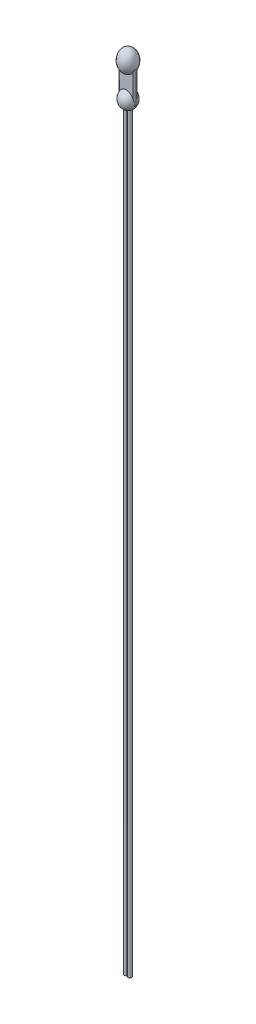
ISO-10303-21;
HEADER;
FILE_DESCRIPTION(('STEP AP214'),'2;1');
FILE_NAME('part.step','',(''),(''),'','','');
FILE_SCHEMA(('AUTOMOTIVE_DESIGN { 1 0 10303 214 1 1 1 1 }'));
ENDSEC;
DATA;
#1=APPLICATION_CONTEXT('core data for automotive mechanical design processes');
#2=APPLICATION_PROTOCOL_DEFINITION('international standard','automotive_design',2000,#1);
#3=PRODUCT_CONTEXT('',#1,'mechanical');
#4=PRODUCT('Part','Part','',(#3));
#5=PRODUCT_RELATED_PRODUCT_CATEGORY('part','',(#4));
#6=PRODUCT_DEFINITION_FORMATION('','',#4);
#7=PRODUCT_DEFINITION_CONTEXT('part definition',#1,'design');
#8=PRODUCT_DEFINITION('design','',#6,#7);
#9=PRODUCT_DEFINITION_SHAPE('','',#8);
#10=(LENGTH_UNIT() NAMED_UNIT(*) SI_UNIT(.MILLI.,.METRE.));
#11=(NAMED_UNIT(*) PLANE_ANGLE_UNIT() SI_UNIT($,.RADIAN.));
#12=(NAMED_UNIT(*) SI_UNIT($,.STERADIAN.) SOLID_ANGLE_UNIT());
#13=UNCERTAINTY_MEASURE_WITH_UNIT(LENGTH_MEASURE(1.E-05),#10,'distance_accuracy_value','');
#14=(GEOMETRIC_REPRESENTATION_CONTEXT(3) GLOBAL_UNCERTAINTY_ASSIGNED_CONTEXT((#13)) GLOBAL_UNIT_ASSIGNED_CONTEXT((#10,
#11,#12)) REPRESENTATION_CONTEXT('',''));
#15=CARTESIAN_POINT('',(0.,0.,0.));
#16=DIRECTION('',(0.,0.,1.));
#17=DIRECTION('',(1.,0.,0.));
#18=AXIS2_PLACEMENT_3D('',#15,#16,#17);
#19=CARTESIAN_POINT('',(0.,0.,0.));
#20=DIRECTION('',(0.,-1.,0.));
#21=DIRECTION('',(0.,0.,-1.));
#22=AXIS2_PLACEMENT_3D('',#19,#20,#21);
#23=PLANE('',#22);
#24=CARTESIAN_POINT('',(2.921,0.,-0.254));
#25=DIRECTION('',(0.,-1.,0.));
#26=DIRECTION('',(0.,0.,-1.));
#27=AXIS2_PLACEMENT_3D('',#24,#25,#26);
#28=CIRCLE('',#27,0.254);
#29=CARTESIAN_POINT('',(3.175,0.,-0.254));
#30=VERTEX_POINT('',#29);
#31=CARTESIAN_POINT('',(3.09711077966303,0.,-0.0709672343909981));
#32=VERTEX_POINT('',#31);
#33=EDGE_CURVE('E295',#30,#32,#28,.T.);
#34=ORIENTED_EDGE('',*,*,#33,.T.);
#35=CARTESIAN_POINT('',(3.0807567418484,0.,0.));
#36=CARTESIAN_POINT('',(3.09158060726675,0.,-0.0423713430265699));
#37=CARTESIAN_POINT('',(3.10059410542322,0.,-0.0851765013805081));
#38=CARTESIAN_POINT('',(3.11495162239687,0.,-0.171412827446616));
#39=CARTESIAN_POINT('',(3.12029438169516,0.,-0.214844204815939));
#40=CARTESIAN_POINT('',(3.13058335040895,0.,-0.343781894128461));
#41=CARTESIAN_POINT('',(3.13026024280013,0.,-0.429790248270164));
#42=CARTESIAN_POINT('',(3.11919053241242,0.,-0.55650510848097));
#43=CARTESIAN_POINT('',(3.1138868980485,0.,-0.597773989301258));
#44=CARTESIAN_POINT('',(3.09988751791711,0.,-0.680165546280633));
#45=CARTESIAN_POINT('',(3.09115773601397,0.,-0.721282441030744));
#46=CARTESIAN_POINT('',(3.08075674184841,0.,-0.761999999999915));
#47=B_SPLINE_CURVE_WITH_KNOTS('',3,(#35,#36,#37,#38,#39,#40,#41,#42,#43,#44,#45,#46),
.UNSPECIFIED.,.F.,.F.,(4,2,2,2,2,4),(0.,0.131100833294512,0.262246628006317,0.518857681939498,
0.643572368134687,0.769558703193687),.UNSPECIFIED.);
#48=CARTESIAN_POINT('',(3.09711077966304,0.,-0.691032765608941));
#49=VERTEX_POINT('',#48);
#50=EDGE_CURVE('E63',#32,#49,#47,.T.);
#51=ORIENTED_EDGE('',*,*,#50,.T.);
#52=CARTESIAN_POINT('',(2.921,0.,-0.508));
#53=DIRECTION('',(0.,-1.,0.));
#54=DIRECTION('',(0.,0.,-1.));
#55=AXIS2_PLACEMENT_3D('',#52,#53,#54);
#56=CIRCLE('',#55,0.254);
#57=CARTESIAN_POINT('',(3.175,0.,-0.508));
#58=VERTEX_POINT('',#57);
#59=EDGE_CURVE('E290',#49,#58,#56,.T.);
#60=ORIENTED_EDGE('',*,*,#59,.T.);
#61=DIRECTION('',(0.,0.,-1.));
#62=VECTOR('',#61,1.);
#63=CARTESIAN_POINT('',(3.175,0.,0.));
#64=LINE('',#63,#62);
#65=EDGE_CURVE('E442',#30,#58,#64,.T.);
#66=ORIENTED_EDGE('',*,*,#65,.F.);
#67=EDGE_LOOP('',(#34,#51,#60,#66));
#68=FACE_BOUND('',#67,.T.);
#69=ADVANCED_FACE('F38',(#68),#23,.T.);
#70=CARTESIAN_POINT('',(0.,6.35,0.));
#71=DIRECTION('',(0.,0.,-1.));
#72=DIRECTION('',(-1.,0.,0.));
#73=AXIS2_PLACEMENT_3D('',#70,#71,#72);
#74=PLANE('',#73);
#75=CARTESIAN_POINT('',(2.92100000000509,1.31720143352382,0.));
#76=CARTESIAN_POINT('',(2.89937165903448,1.35852843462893,0.));
#77=CARTESIAN_POINT('',(2.87613483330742,1.39899583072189,0.));
#78=CARTESIAN_POINT('',(2.82648177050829,1.4779572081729,0.));
#79=CARTESIAN_POINT('',(2.80006395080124,1.51645019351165,0.));
#80=CARTESIAN_POINT('',(2.71593199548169,1.62878971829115,0.));
#81=CARTESIAN_POINT('',(2.65349334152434,1.69919984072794,0.));
#82=CARTESIAN_POINT('',(2.51704221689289,1.82825087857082,0.));
#83=CARTESIAN_POINT('',(2.44299222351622,1.88685217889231,0.));
#84=CARTESIAN_POINT('',(2.28540081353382,1.98921218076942,0.));
#85=CARTESIAN_POINT('',(2.20188098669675,2.0330037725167,0.));
#86=CARTESIAN_POINT('',(2.03573954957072,2.10032893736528,0.));
#87=CARTESIAN_POINT('',(1.95371221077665,2.12532979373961,0.));
#88=CARTESIAN_POINT('',(1.78643637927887,2.15992908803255,0.));
#89=CARTESIAN_POINT('',(1.70118798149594,2.16952797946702,0.));
#90=CARTESIAN_POINT('',(1.53694983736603,2.17270718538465,0.));
#91=CARTESIAN_POINT('',(1.45798030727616,2.16745697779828,0.));
#92=CARTESIAN_POINT('',(1.30209952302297,2.1436436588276,0.));
#93=CARTESIAN_POINT('',(1.2251877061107,2.12508422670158,0.));
#94=CARTESIAN_POINT('',(1.07612662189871,2.07566527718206,0.));
#95=CARTESIAN_POINT('',(1.00394447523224,2.04490428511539,0.));
#96=CARTESIAN_POINT('',(0.865383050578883,1.97231625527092,0.));
#97=CARTESIAN_POINT('',(0.799005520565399,1.93048589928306,0.));
#98=CARTESIAN_POINT('',(0.669866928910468,1.83463412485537,0.));
#99=CARTESIAN_POINT('',(0.607517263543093,1.78006070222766,0.));
#100=CARTESIAN_POINT('',(0.491865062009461,1.66206521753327,0.));
#101=CARTESIAN_POINT('',(0.438562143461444,1.59864352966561,0.));
#102=CARTESIAN_POINT('',(0.364700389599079,1.4965685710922,0.));
#103=CARTESIAN_POINT('',(0.340595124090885,1.46042117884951,0.));
#104=CARTESIAN_POINT('',(0.295200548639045,1.38652778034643,0.));
#105=CARTESIAN_POINT('',(0.273904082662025,1.34878617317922,0.));
#106=CARTESIAN_POINT('',(0.253999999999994,1.31031230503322,0.));
#107=B_SPLINE_CURVE_WITH_KNOTS('',3,(#75,#76,#77,#78,#79,#80,#81,#82,#83,#84,#85,#86,#87,#88,
#89,#90,#91,#92,#93,#94,#95,#96,#97,#98,#99,#100,#101,#102,#103,#104,#105,#106),.UNSPECIFIED.,
.F.,.F.,(4,2,2,2,2,2,2,2,2,2,2,2,2,2,2,4),(0.,0.1398618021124,0.27979347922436,
0.560648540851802,0.84243065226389,1.12358279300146,1.3794590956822,1.63532786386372,
1.87161859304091,2.10784402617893,2.34219959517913,2.57662549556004,2.82419438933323,
3.07175281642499,3.20199111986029,3.33189092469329),.UNSPECIFIED.);
#108=CARTESIAN_POINT('',(2.921,1.31720143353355,0.));
#109=VERTEX_POINT('',#108);
#110=CARTESIAN_POINT('',(0.253999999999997,1.31031230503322,0.));
#111=VERTEX_POINT('',#110);
#112=EDGE_CURVE('E397',#109,#111,#107,.T.);
#113=ORIENTED_EDGE('',*,*,#112,.F.);
#114=DIRECTION('',(0.,-1.,0.));
#115=VECTOR('',#114,1.);
#116=CARTESIAN_POINT('',(2.921,6.35,0.));
#117=LINE('',#116,#115);
#118=CARTESIAN_POINT('',(2.92100000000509,5.86515257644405,0.));
#119=VERTEX_POINT('',#118);
#120=EDGE_CURVE('E311',#109,#119,#117,.F.);
#121=ORIENTED_EDGE('',*,*,#120,.T.);
#122=CARTESIAN_POINT('',(0.0463980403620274,6.35,0.));
#123=CARTESIAN_POINT('',(0.0812216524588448,6.23571143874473,0.));
#124=CARTESIAN_POINT('',(0.124231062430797,6.12350891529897,0.));
#125=CARTESIAN_POINT('',(0.227472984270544,5.90623723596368,0.));
#126=CARTESIAN_POINT('',(0.287846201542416,5.80123540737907,0.));
#127=CARTESIAN_POINT('',(0.413159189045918,5.62188694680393,0.));
#128=CARTESIAN_POINT('',(0.475127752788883,5.54548153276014,0.));
#129=CARTESIAN_POINT('',(0.610404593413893,5.40375790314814,0.));
#130=CARTESIAN_POINT('',(0.68367481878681,5.33840397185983,0.));
#131=CARTESIAN_POINT('',(0.82752216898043,5.23185667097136,0.));
#132=CARTESIAN_POINT('',(0.896450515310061,5.18844570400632,0.));
#133=CARTESIAN_POINT('',(1.0406066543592,5.11359867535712,0.));
#134=CARTESIAN_POINT('',(1.11583401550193,5.0821617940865,0.));
#135=CARTESIAN_POINT('',(1.27119586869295,5.03310208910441,0.));
#136=CARTESIAN_POINT('',(1.35135595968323,5.0155592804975,0.));
#137=CARTESIAN_POINT('',(1.51353995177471,4.99591588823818,0.));
#138=CARTESIAN_POINT('',(1.59556282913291,4.99380701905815,0.));
#139=CARTESIAN_POINT('',(1.75022163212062,5.00458580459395,0.));
#140=CARTESIAN_POINT('',(1.82296723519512,5.01597690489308,0.));
#141=CARTESIAN_POINT('',(1.96555996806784,5.0506103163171,0.));
#142=CARTESIAN_POINT('',(2.03540686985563,5.07385355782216,0.));
#143=CARTESIAN_POINT('',(2.1718530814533,5.13144212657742,0.));
#144=CARTESIAN_POINT('',(2.23836794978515,5.16598568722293,0.));
#145=CARTESIAN_POINT('',(2.36560393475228,5.24439091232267,0.));
#146=CARTESIAN_POINT('',(2.42632360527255,5.28825489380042,0.));
#147=CARTESIAN_POINT('',(2.56408159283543,5.40253650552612,0.));
#148=CARTESIAN_POINT('',(2.63810123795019,5.47660131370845,0.));
#149=CARTESIAN_POINT('',(2.77320029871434,5.63594696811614,0.));
#150=CARTESIAN_POINT('',(2.83423614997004,5.72126406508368,0.));
#151=CARTESIAN_POINT('',(2.94035697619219,5.89506467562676,0.));
#152=CARTESIAN_POINT('',(2.9861129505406,5.98314449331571,0.));
#153=CARTESIAN_POINT('',(3.06587922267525,6.16366696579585,0.));
#154=CARTESIAN_POINT('',(3.09997893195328,6.25606993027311,0.));
#155=CARTESIAN_POINT('',(3.12860195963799,6.35000000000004,0.));
#156=B_SPLINE_CURVE_WITH_KNOTS('',3,(#122,#123,#124,#125,#126,#127,#128,#129,#130,#131,#132,
#133,#134,#135,#136,#137,#138,#139,#140,#141,#142,#143,#144,#145,#146,#147,#148,#149,#150,#151,
#152,#153,#154,#155),.UNSPECIFIED.,.F.,.F.,(4,2,2,2,2,2,2,2,2,2,2,2,2,2,2,2,4),(0.,
0.358762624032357,0.720518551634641,1.01454527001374,1.30760281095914,1.55098462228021,
1.7943497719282,2.03910645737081,2.28373173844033,2.50359247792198,2.72347047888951,
2.94743339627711,3.171452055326,3.48389258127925,3.79736545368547,4.09432151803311,
4.38894573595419),.UNSPECIFIED.);
#157=CARTESIAN_POINT('',(0.254000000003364,5.86515257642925,0.));
#158=VERTEX_POINT('',#157);
#159=EDGE_CURVE('E383',#158,#119,#156,.T.);
#160=ORIENTED_EDGE('',*,*,#159,.F.);
#161=DIRECTION('',(0.,-1.,0.));
#162=VECTOR('',#161,1.);
#163=CARTESIAN_POINT('',(0.254,6.35,0.));
#164=LINE('',#163,#162);
#165=EDGE_CURVE('E313',#158,#111,#164,.T.);
#166=ORIENTED_EDGE('',*,*,#165,.T.);
#167=EDGE_LOOP('',(#113,#121,#160,#166));
#168=FACE_BOUND('',#167,.T.);
#169=ADVANCED_FACE('F251',(#168),#74,.F.);
#170=CARTESIAN_POINT('',(0.,6.35,-0.762));
#171=DIRECTION('',(0.,0.,1.));
#172=DIRECTION('',(1.,0.,0.));
#173=AXIS2_PLACEMENT_3D('',#170,#171,#172);
#174=PLANE('',#173);
#175=CARTESIAN_POINT('',(0.253999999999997,1.31031230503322,-0.762000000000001));
#176=CARTESIAN_POINT('',(0.27545233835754,1.35177630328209,-0.762));
#177=CARTESIAN_POINT('',(0.298518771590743,1.39238741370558,-0.762));
#178=CARTESIAN_POINT('',(0.347843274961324,1.47164930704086,-0.762));
#179=CARTESIAN_POINT('',(0.3741029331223,1.51029910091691,-0.762));
#180=CARTESIAN_POINT('',(0.457780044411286,1.62312993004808,-0.761999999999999));
#181=CARTESIAN_POINT('',(0.519942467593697,1.69389356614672,-0.761999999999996));
#182=CARTESIAN_POINT('',(0.655906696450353,1.82369513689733,-0.761999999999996));
#183=CARTESIAN_POINT('',(0.729746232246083,1.88269360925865,-0.761999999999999));
#184=CARTESIAN_POINT('',(0.8869956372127,1.98587729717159,-0.762000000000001));
#185=CARTESIAN_POINT('',(0.97038372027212,2.03009536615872,-0.762));
#186=CARTESIAN_POINT('',(1.13634505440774,2.09824105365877,-0.762));
#187=CARTESIAN_POINT('',(1.21831563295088,2.12363713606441,-0.762));
#188=CARTESIAN_POINT('',(1.38555199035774,2.15902346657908,-0.762));
#189=CARTESIAN_POINT('',(1.47081765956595,2.16901422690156,-0.761999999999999));
#190=CARTESIAN_POINT('',(1.6351230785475,2.17292605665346,-0.761999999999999));
#191=CARTESIAN_POINT('',(1.71413724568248,2.16802407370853,-0.761999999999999));
#192=CARTESIAN_POINT('',(1.87016436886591,2.14488867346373,-0.762000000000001));
#193=CARTESIAN_POINT('',(1.94717787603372,2.12665896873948,-0.762000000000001));
#194=CARTESIAN_POINT('',(2.0964592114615,2.0778779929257,-0.762));
#195=CARTESIAN_POINT('',(2.1687612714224,2.04743078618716,-0.761999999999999));
#196=CARTESIAN_POINT('',(2.30760840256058,1.97544330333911,-0.762000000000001));
#197=CARTESIAN_POINT('',(2.37415174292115,1.93389970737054,-0.762000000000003));
#198=CARTESIAN_POINT('',(2.50364728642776,1.83862081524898,-0.761999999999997));
#199=CARTESIAN_POINT('',(2.5661930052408,1.78433532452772,-0.761999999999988));
#200=CARTESIAN_POINT('',(2.68227707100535,1.66688136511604,-0.762000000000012));
#201=CARTESIAN_POINT('',(2.73581585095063,1.60371332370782,-0.762000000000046));
#202=CARTESIAN_POINT('',(2.80996122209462,1.50213496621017,-0.76200000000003));
#203=CARTESIAN_POINT('',(2.83411326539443,1.4662516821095,-0.762000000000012));
#204=CARTESIAN_POINT('',(2.87963134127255,1.39288744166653,-0.761999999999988));
#205=CARTESIAN_POINT('',(2.90100444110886,1.35541087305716,-0.761999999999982));
#206=CARTESIAN_POINT('',(2.921,1.31720143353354,-0.762));
#207=B_SPLINE_CURVE_WITH_KNOTS('',3,(#175,#176,#177,#178,#179,#180,#181,#182,#183,#184,#185,
#186,#187,#188,#189,#190,#191,#192,#193,#194,#195,#196,#197,#198,#199,#200,#201,#202,#203,#204,
#205,#206),.UNSPECIFIED.,.F.,.F.,(4,2,2,2,2,2,2,2,2,2,2,2,2,2,2,4),(0.,0.139982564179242,
0.280035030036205,0.561135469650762,0.843163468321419,1.12456034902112,1.38062033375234,
1.63667180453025,1.87302816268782,2.10931870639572,2.34363794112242,2.57802735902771,
2.82547243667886,3.0729056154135,3.20256516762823,3.33188824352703),.UNSPECIFIED.);
#208=CARTESIAN_POINT('',(0.253999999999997,1.31031230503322,-0.762000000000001));
#209=VERTEX_POINT('',#208);
#210=CARTESIAN_POINT('',(2.92099999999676,1.31720143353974,-0.762));
#211=VERTEX_POINT('',#210);
#212=EDGE_CURVE('E359',#209,#211,#207,.T.);
#213=ORIENTED_EDGE('',*,*,#212,.F.);
#214=DIRECTION('',(0.,-1.,0.));
#215=VECTOR('',#214,1.);
#216=CARTESIAN_POINT('',(0.254,6.35,-0.762));
#217=LINE('',#216,#215);
#218=CARTESIAN_POINT('',(0.254000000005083,5.86515257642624,-0.761999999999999));
#219=VERTEX_POINT('',#218);
#220=EDGE_CURVE('E445',#209,#219,#217,.F.);
#221=ORIENTED_EDGE('',*,*,#220,.T.);
#222=CARTESIAN_POINT('',(3.12860195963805,6.35000000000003,-0.761999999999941));
#223=CARTESIAN_POINT('',(3.09377834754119,6.23571143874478,-0.761999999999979));
#224=CARTESIAN_POINT('',(3.05076893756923,6.12350891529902,-0.761999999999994));
#225=CARTESIAN_POINT('',(2.94752701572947,5.90623723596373,-0.762000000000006));
#226=CARTESIAN_POINT('',(2.88715379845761,5.80123540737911,-0.762000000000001));
#227=CARTESIAN_POINT('',(2.76184081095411,5.62188694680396,-0.761999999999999));
#228=CARTESIAN_POINT('',(2.69987224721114,5.54548153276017,-0.762));
#229=CARTESIAN_POINT('',(2.56459540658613,5.40375790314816,-0.762));
#230=CARTESIAN_POINT('',(2.49132518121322,5.33840397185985,-0.762));
#231=CARTESIAN_POINT('',(2.3474778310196,5.23185667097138,-0.762));
#232=CARTESIAN_POINT('',(2.27854948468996,5.18844570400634,-0.762));
#233=CARTESIAN_POINT('',(2.13439334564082,5.11359867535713,-0.762));
#234=CARTESIAN_POINT('',(2.0591659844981,5.08216179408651,-0.762));
#235=CARTESIAN_POINT('',(1.90380413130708,5.03310208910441,-0.762));
#236=CARTESIAN_POINT('',(1.82364404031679,5.01555928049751,-0.762));
#237=CARTESIAN_POINT('',(1.66146004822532,4.99591588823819,-0.762));
#238=CARTESIAN_POINT('',(1.57943717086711,4.99380701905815,-0.762));
#239=CARTESIAN_POINT('',(1.4247783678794,5.00458580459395,-0.762));
#240=CARTESIAN_POINT('',(1.3520327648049,5.01597690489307,-0.762));
#241=CARTESIAN_POINT('',(1.20944003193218,5.05061031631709,-0.762));
#242=CARTESIAN_POINT('',(1.13959313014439,5.07385355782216,-0.762));
#243=CARTESIAN_POINT('',(1.00314691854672,5.13144212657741,-0.762));
#244=CARTESIAN_POINT('',(0.936632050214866,5.16598568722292,-0.762000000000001));
#245=CARTESIAN_POINT('',(0.80939606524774,5.24439091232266,-0.761999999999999));
#246=CARTESIAN_POINT('',(0.748676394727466,5.28825489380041,-0.761999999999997));
#247=CARTESIAN_POINT('',(0.610918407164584,5.40253650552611,-0.762000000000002));
#248=CARTESIAN_POINT('',(0.536898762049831,5.47660131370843,-0.762000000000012));
#249=CARTESIAN_POINT('',(0.401799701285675,5.63594696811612,-0.761999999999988));
#250=CARTESIAN_POINT('',(0.340763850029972,5.72126406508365,-0.761999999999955));
#251=CARTESIAN_POINT('',(0.234643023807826,5.89506467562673,-0.761999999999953));
#252=CARTESIAN_POINT('',(0.188887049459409,5.9831444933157,-0.76199999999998));
#253=CARTESIAN_POINT('',(0.109120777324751,6.16366696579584,-0.762000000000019));
#254=CARTESIAN_POINT('',(0.0750210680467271,6.2560699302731,-0.762000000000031));
#255=CARTESIAN_POINT('',(0.0463980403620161,6.35000000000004,-0.762));
#256=B_SPLINE_CURVE_WITH_KNOTS('',3,(#222,#223,#224,#225,#226,#227,#228,#229,#230,#231,#232,
#233,#234,#235,#236,#237,#238,#239,#240,#241,#242,#243,#244,#245,#246,#247,#248,#249,#250,#251,
#252,#253,#254,#255),.UNSPECIFIED.,.F.,.F.,(4,2,2,2,2,2,2,2,2,2,2,2,2,2,2,2,4),(0.,
0.358762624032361,0.720518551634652,1.01454527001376,1.30760281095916,1.55098462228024,
1.79434977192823,2.03910645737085,2.28373173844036,2.50359247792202,2.72347047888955,
2.94743339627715,3.17145205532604,3.48389258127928,3.7973654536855,4.09432151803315,
4.38894573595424),.UNSPECIFIED.);
#257=CARTESIAN_POINT('',(2.92099999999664,5.86515257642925,-0.761999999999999));
#258=VERTEX_POINT('',#257);
#259=EDGE_CURVE('E376',#258,#219,#256,.T.);
#260=ORIENTED_EDGE('',*,*,#259,.F.);
#261=DIRECTION('',(0.,-1.,0.));
#262=VECTOR('',#261,1.);
#263=CARTESIAN_POINT('',(2.921,6.35,-0.762));
#264=LINE('',#263,#262);
#265=EDGE_CURVE('E447',#258,#211,#264,.T.);
#266=ORIENTED_EDGE('',*,*,#265,.T.);
#267=EDGE_LOOP('',(#213,#221,#260,#266));
#268=FACE_BOUND('',#267,.T.);
#269=ADVANCED_FACE('F258',(#268),#174,.F.);
#270=CARTESIAN_POINT('',(3.175,6.35,0.));
#271=DIRECTION('',(-1.,0.,0.));
#272=DIRECTION('',(0.,0.,1.));
#273=AXIS2_PLACEMENT_3D('',#270,#271,#272);
#274=PLANE('',#273);
#275=ORIENTED_EDGE('',*,*,#65,.T.);
#276=DIRECTION('',(0.,-1.,0.));
#277=VECTOR('',#276,1.);
#278=CARTESIAN_POINT('',(3.175,6.35,-0.508));
#279=LINE('',#278,#277);
#280=CARTESIAN_POINT('',(3.175,6.35,-0.508));
#281=VERTEX_POINT('',#280);
#282=EDGE_CURVE('E301',#58,#281,#279,.F.);
#283=ORIENTED_EDGE('',*,*,#282,.T.);
#284=DIRECTION('',(0.,0.,-1.));
#285=VECTOR('',#284,1.);
#286=CARTESIAN_POINT('',(3.175,6.35,0.));
#287=LINE('',#286,#285);
#288=CARTESIAN_POINT('',(3.175,6.35,-0.381));
#289=VERTEX_POINT('',#288);
#290=EDGE_CURVE('E435',#289,#281,#287,.T.);
#291=ORIENTED_EDGE('',*,*,#290,.F.);
#292=CARTESIAN_POINT('',(3.175,6.35,-0.254));
#293=VERTEX_POINT('',#292);
#294=EDGE_CURVE('E427',#293,#289,#287,.T.);
#295=ORIENTED_EDGE('',*,*,#294,.F.);
#296=DIRECTION('',(0.,-1.,0.));
#297=VECTOR('',#296,1.);
#298=CARTESIAN_POINT('',(3.175,6.35,-0.254));
#299=LINE('',#298,#297);
#300=EDGE_CURVE('E293',#293,#30,#299,.T.);
#301=ORIENTED_EDGE('',*,*,#300,.T.);
#302=EDGE_LOOP('',(#275,#283,#291,#295,#301));
#303=FACE_BOUND('',#302,.T.);
#304=CARTESIAN_POINT('',(3.175,0.318296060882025,-0.381));
#305=CARTESIAN_POINT('',(3.17500000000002,0.3183064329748,-0.393220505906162));
#306=CARTESIAN_POINT('',(3.175,0.320587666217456,-0.405506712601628));
#307=CARTESIAN_POINT('',(3.17499999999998,0.329240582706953,-0.428432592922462));
#308=CARTESIAN_POINT('',(3.17499999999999,0.33560425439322,-0.439075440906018));
#309=CARTESIAN_POINT('',(3.175,0.351312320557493,-0.457782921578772));
#310=CARTESIAN_POINT('',(3.175,0.360653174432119,-0.465850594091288));
#311=CARTESIAN_POINT('',(3.175,0.382309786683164,-0.479681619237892));
#312=CARTESIAN_POINT('',(3.17499999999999,0.394835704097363,-0.485110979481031));
#313=CARTESIAN_POINT('',(3.17499999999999,0.422208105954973,-0.492461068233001));
#314=CARTESIAN_POINT('',(3.17499999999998,0.437161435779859,-0.493977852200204));
#315=CARTESIAN_POINT('',(3.17499999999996,0.467683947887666,-0.492255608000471));
#316=CARTESIAN_POINT('',(3.17499999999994,0.483238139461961,-0.488733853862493));
#317=CARTESIAN_POINT('',(3.17499999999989,0.512047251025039,-0.476583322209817));
#318=CARTESIAN_POINT('',(3.17499999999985,0.525328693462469,-0.468019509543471));
#319=CARTESIAN_POINT('',(3.17499999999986,0.546713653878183,-0.447299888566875));
#320=CARTESIAN_POINT('',(3.17499999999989,0.555158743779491,-0.435506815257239));
#321=CARTESIAN_POINT('',(3.17499999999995,0.566055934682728,-0.410999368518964));
#322=CARTESIAN_POINT('',(3.17499999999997,0.569085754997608,-0.39854709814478));
#323=CARTESIAN_POINT('',(3.17499999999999,0.570283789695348,-0.374469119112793));
#324=CARTESIAN_POINT('',(3.175,0.568839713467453,-0.362862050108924));
#325=CARTESIAN_POINT('',(3.175,0.562254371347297,-0.340960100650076));
#326=CARTESIAN_POINT('',(3.175,0.557166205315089,-0.330648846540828));
#327=CARTESIAN_POINT('',(3.175,0.543788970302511,-0.311561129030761));
#328=CARTESIAN_POINT('',(3.175,0.535342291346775,-0.302897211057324));
#329=CARTESIAN_POINT('',(3.175,0.515426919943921,-0.287665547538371));
#330=CARTESIAN_POINT('',(3.175,0.503745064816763,-0.281381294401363));
#331=CARTESIAN_POINT('',(3.17499999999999,0.477799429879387,-0.271958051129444));
#332=CARTESIAN_POINT('',(3.17499999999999,0.463393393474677,-0.269216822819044));
#333=CARTESIAN_POINT('',(3.17499999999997,0.433354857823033,-0.268184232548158));
#334=CARTESIAN_POINT('',(3.17499999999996,0.417710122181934,-0.270235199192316));
#335=CARTESIAN_POINT('',(3.17499999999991,0.387830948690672,-0.279494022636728));
#336=CARTESIAN_POINT('',(3.17499999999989,0.373610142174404,-0.286747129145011));
#337=CARTESIAN_POINT('',(3.17499999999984,0.349666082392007,-0.305510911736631));
#338=CARTESIAN_POINT('',(3.17499999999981,0.339706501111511,-0.316706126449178));
#339=CARTESIAN_POINT('',(3.17499999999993,0.329091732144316,-0.335000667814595));
#340=CARTESIAN_POINT('',(3.17499999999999,0.326338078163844,-0.34093594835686));
#341=CARTESIAN_POINT('',(3.17500000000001,0.321992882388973,-0.353212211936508));
#342=CARTESIAN_POINT('',(3.17499999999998,0.320398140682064,-0.359552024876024));
#343=CARTESIAN_POINT('',(3.17499999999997,0.318672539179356,-0.370947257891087));
#344=CARTESIAN_POINT('',(3.17499999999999,0.318291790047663,-0.375968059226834));
#345=CARTESIAN_POINT('',(3.175,0.318296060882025,-0.381));
#346=B_SPLINE_CURVE_WITH_KNOTS('',3,(#304,#305,#306,#307,#308,#309,#310,#311,#312,#313,#314,
#315,#316,#317,#318,#319,#320,#321,#322,#323,#324,#325,#326,#327,#328,#329,#330,#331,#332,#333,
#334,#335,#336,#337,#338,#339,#340,#341,#342,#343,#344,#345),.UNSPECIFIED.,.T.,.F.,(4,2,2,2,2,2,
2,2,2,2,2,2,2,2,2,2,2,2,2,2,4),(0.,0.0365852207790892,0.0730988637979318,0.109569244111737,
0.149897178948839,0.194247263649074,0.241185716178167,0.287532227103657,0.329980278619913,
0.367544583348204,0.401947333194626,0.435858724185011,0.471596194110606,0.510787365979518,
0.554078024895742,0.600554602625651,0.647440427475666,0.691206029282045,0.710740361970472,
0.73022055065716,0.745284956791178),.UNSPECIFIED.);
#347=CARTESIAN_POINT('',(3.175,0.318296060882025,-0.381));
#348=VERTEX_POINT('',#347);
#349=EDGE_CURVE('E11',#348,#348,#346,.T.);
#350=ORIENTED_EDGE('',*,*,#349,.F.);
#351=EDGE_LOOP('',(#350));
#352=FACE_BOUND('',#351,.T.);
#353=ADVANCED_FACE('F267',(#303,#352),#274,.F.);
#354=CARTESIAN_POINT('',(0.254,0.,-0.508));
#355=DIRECTION('',(0.,-1.,0.));
#356=DIRECTION('',(0.,0.,-1.));
#357=AXIS2_PLACEMENT_3D('',#354,#355,#356);
#358=CIRCLE('',#357,0.254);
#359=CARTESIAN_POINT('',(0.,0.,-0.508));
#360=VERTEX_POINT('',#359);
#361=CARTESIAN_POINT('',(0.0830716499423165,0.,-0.695881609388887));
#362=VERTEX_POINT('',#361);
#363=EDGE_CURVE('E281',#360,#362,#358,.T.);
#364=ORIENTED_EDGE('',*,*,#363,.T.);
#365=CARTESIAN_POINT('',(0.0984203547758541,0.,-0.762));
#366=CARTESIAN_POINT('',(0.08759648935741,0.,-0.719628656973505));
#367=CARTESIAN_POINT('',(0.0785829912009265,0.,-0.676823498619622));
#368=CARTESIAN_POINT('',(0.0642254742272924,0.,-0.590587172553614));
#369=CARTESIAN_POINT('',(0.0588827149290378,0.,-0.547155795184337));
#370=CARTESIAN_POINT('',(0.048593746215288,0.,-0.418218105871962));
#371=CARTESIAN_POINT('',(0.0489168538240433,0.,-0.332209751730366));
#372=CARTESIAN_POINT('',(0.0599865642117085,0.,-0.20549489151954));
#373=CARTESIAN_POINT('',(0.0652901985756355,0.,-0.164226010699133));
#374=CARTESIAN_POINT('',(0.0792895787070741,0.,-0.0818344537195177));
#375=CARTESIAN_POINT('',(0.0880193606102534,0.,-0.0407175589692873));
#376=CARTESIAN_POINT('',(0.0984203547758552,0.,0.));
#377=B_SPLINE_CURVE_WITH_KNOTS('',3,(#365,#366,#367,#368,#369,#370,#371,#372,#373,#374,#375,
#376),.UNSPECIFIED.,.F.,.F.,(4,2,2,2,2,4),(0.,0.131100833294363,0.262246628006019,
0.518857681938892,0.64357236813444,0.76955870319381),.UNSPECIFIED.);
#378=CARTESIAN_POINT('',(0.0830716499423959,0.,-0.0661183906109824));
#379=VERTEX_POINT('',#378);
#380=EDGE_CURVE('E282',#362,#379,#377,.T.);
#381=ORIENTED_EDGE('',*,*,#380,.T.);
#382=CARTESIAN_POINT('',(0.254,0.,-0.254));
#383=DIRECTION('',(0.,-1.,0.));
#384=DIRECTION('',(0.,0.,-1.));
#385=AXIS2_PLACEMENT_3D('',#382,#383,#384);
#386=CIRCLE('',#385,0.254);
#387=CARTESIAN_POINT('',(0.,0.,-0.254));
#388=VERTEX_POINT('',#387);
#389=EDGE_CURVE('E291',#379,#388,#386,.T.);
#390=ORIENTED_EDGE('',*,*,#389,.T.);
#391=DIRECTION('',(0.,0.,1.));
#392=VECTOR('',#391,1.);
#393=CARTESIAN_POINT('',(0.,0.,0.));
#394=LINE('',#393,#392);
#395=EDGE_CURVE('E285',#360,#388,#394,.T.);
#396=ORIENTED_EDGE('',*,*,#395,.F.);
#397=EDGE_LOOP('',(#364,#381,#390,#396));
#398=FACE_BOUND('',#397,.T.);
#399=ADVANCED_FACE('F254',(#398),#23,.T.);
#400=CARTESIAN_POINT('',(2.921,6.35,-0.508));
#401=DIRECTION('',(0.,-1.,0.));
#402=DIRECTION('',(0.,0.,-1.));
#403=AXIS2_PLACEMENT_3D('',#400,#401,#402);
#404=CYLINDRICAL_SURFACE('',#403,0.254);
#405=ORIENTED_EDGE('',*,*,#59,.F.);
#406=CARTESIAN_POINT('',(3.09711077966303,0.,-0.691032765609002));
#407=CARTESIAN_POINT('',(3.10272678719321,0.0191562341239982,-0.685630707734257));
#408=CARTESIAN_POINT('',(3.10804027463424,0.0383409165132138,-0.68001905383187));
#409=CARTESIAN_POINT('',(3.11806184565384,0.0768182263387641,-0.668440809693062));
#410=CARTESIAN_POINT('',(3.12276834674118,0.096111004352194,-0.662473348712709));
#411=CARTESIAN_POINT('',(3.13155298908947,0.134785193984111,-0.650267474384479));
#412=CARTESIAN_POINT('',(3.13563022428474,0.154166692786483,-0.644028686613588));
#413=CARTESIAN_POINT('',(3.14359617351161,0.195400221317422,-0.630617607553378));
#414=CARTESIAN_POINT('',(3.14739960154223,0.217262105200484,-0.623425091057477));
#415=CARTESIAN_POINT('',(3.15415290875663,0.26110322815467,-0.609082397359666));
#416=CARTESIAN_POINT('',(3.15710385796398,0.283082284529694,-0.60193217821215));
#417=CARTESIAN_POINT('',(3.16084175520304,0.316261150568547,-0.591698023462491));
#418=CARTESIAN_POINT('',(3.16197235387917,0.327347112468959,-0.588370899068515));
#419=CARTESIAN_POINT('',(3.16398505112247,0.349637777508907,-0.582061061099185));
#420=CARTESIAN_POINT('',(3.16486726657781,0.360842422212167,-0.579078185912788));
#421=CARTESIAN_POINT('',(3.16599567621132,0.378096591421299,-0.575046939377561));
#422=CARTESIAN_POINT('',(3.16634541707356,0.384080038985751,-0.573750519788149));
#423=CARTESIAN_POINT('',(3.16695612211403,0.396102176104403,-0.57142686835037));
#424=CARTESIAN_POINT('',(3.16721709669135,0.402140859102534,-0.570399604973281));
#425=CARTESIAN_POINT('',(3.16784153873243,0.420134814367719,-0.567904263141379));
#426=CARTESIAN_POINT('',(3.168061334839,0.432182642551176,-0.566965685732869));
#427=CARTESIAN_POINT('',(3.1680590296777,0.452761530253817,-0.566971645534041));
#428=CARTESIAN_POINT('',(3.16794701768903,0.461294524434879,-0.567447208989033));
#429=CARTESIAN_POINT('',(3.1675178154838,0.478274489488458,-0.569202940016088));
#430=CARTESIAN_POINT('',(3.16720041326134,0.48672136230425,-0.570483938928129));
#431=CARTESIAN_POINT('',(3.16597599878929,0.512119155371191,-0.575176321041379));
#432=CARTESIAN_POINT('',(3.16479825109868,0.528891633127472,-0.579424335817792));
#433=CARTESIAN_POINT('',(3.16164361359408,0.564988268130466,-0.589484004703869));
#434=CARTESIAN_POINT('',(3.15956449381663,0.584258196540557,-0.595438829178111));
#435=CARTESIAN_POINT('',(3.15473538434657,0.622625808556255,-0.60763555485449));
#436=CARTESIAN_POINT('',(3.15198533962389,0.641723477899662,-0.61387747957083));
#437=CARTESIAN_POINT('',(3.14584428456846,0.6798342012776,-0.626362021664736));
#438=CARTESIAN_POINT('',(3.14245267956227,0.69884715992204,-0.632604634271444));
#439=CARTESIAN_POINT('',(3.13504906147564,0.736800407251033,-0.644933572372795));
#440=CARTESIAN_POINT('',(3.13103710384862,0.755740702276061,-0.651019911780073));
#441=CARTESIAN_POINT('',(3.11815708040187,0.81218257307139,-0.668804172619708));
#442=CARTESIAN_POINT('',(3.10839617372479,0.849603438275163,-0.680128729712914));
#443=CARTESIAN_POINT('',(3.08658308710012,0.924210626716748,-0.701206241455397));
#444=CARTESIAN_POINT('',(3.07453162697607,0.961397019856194,-0.710959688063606));
#445=CARTESIAN_POINT('',(3.05188521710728,1.02524499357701,-0.725979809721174));
#446=CARTESIAN_POINT('',(3.04180844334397,1.051974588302,-0.73174148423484));
#447=CARTESIAN_POINT('',(3.02057517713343,1.1052433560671,-0.741964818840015));
#448=CARTESIAN_POINT('',(3.00941911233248,1.1317826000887,-0.746426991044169));
#449=CARTESIAN_POINT('',(2.98594105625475,1.18497794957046,-0.753871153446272));
#450=CARTESIAN_POINT('',(2.97360577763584,1.21163107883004,-0.756833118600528));
#451=CARTESIAN_POINT('',(2.94798611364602,1.26465540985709,-0.76089303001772));
#452=CARTESIAN_POINT('',(2.93470067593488,1.29102626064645,-0.761988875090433));
#453=CARTESIAN_POINT('',(2.92099999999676,1.31720143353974,-0.762));
#454=B_SPLINE_CURVE_WITH_KNOTS('',3,(#406,#407,#408,#409,#410,#411,#412,#413,#414,#415,#416,
#417,#418,#419,#420,#421,#422,#423,#424,#425,#426,#427,#428,#429,#430,#431,#432,#433,#434,#435,
#436,#437,#438,#439,#440,#441,#442,#443,#444,#445,#446,#447,#448,#449,#450,#451,#452,#453),
.UNSPECIFIED.,.F.,.F.,(4,2,2,2,2,2,2,2,2,2,2,2,2,2,2,2,2,2,2,2,2,2,2,4),(0.,0.0620367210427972,
0.124232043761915,0.186516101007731,0.256482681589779,0.326361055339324,0.361245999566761,
0.396114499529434,0.414505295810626,0.432893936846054,0.469007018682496,0.494598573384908,
0.52021658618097,0.572152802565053,0.632972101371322,0.693796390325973,0.754677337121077,
0.815552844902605,0.936349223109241,1.05710770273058,1.14448713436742,1.23183208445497,
1.3203140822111,1.40889564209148),.UNSPECIFIED.);
#455=EDGE_CURVE('E340',#49,#211,#454,.T.);
#456=ORIENTED_EDGE('',*,*,#455,.T.);
#457=ORIENTED_EDGE('',*,*,#265,.F.);
#458=CARTESIAN_POINT('',(3.16104434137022,6.35,-0.591034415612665));
#459=CARTESIAN_POINT('',(3.15870598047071,6.3451736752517,-0.597764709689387));
#460=CARTESIAN_POINT('',(3.15622461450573,6.33987185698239,-0.604051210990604));
#461=CARTESIAN_POINT('',(3.15105827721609,6.32861476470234,-0.615850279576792));
#462=CARTESIAN_POINT('',(3.14837452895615,6.32266333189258,-0.621366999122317));
#463=CARTESIAN_POINT('',(3.14289105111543,6.3104180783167,-0.631749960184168));
#464=CARTESIAN_POINT('',(3.14009309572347,6.30412921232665,-0.636623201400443));
#465=CARTESIAN_POINT('',(3.13437332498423,6.29125308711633,-0.645904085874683));
#466=CARTESIAN_POINT('',(3.13145129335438,6.28466530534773,-0.650310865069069));
#467=CARTESIAN_POINT('',(3.12122304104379,6.26165277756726,-0.664799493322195));
#468=CARTESIAN_POINT('',(3.11366562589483,6.2447298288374,-0.673910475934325));
#469=CARTESIAN_POINT('',(3.09807159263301,6.2103089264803,-0.690454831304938));
#470=CARTESIAN_POINT('',(3.09003457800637,6.19281050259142,-0.697886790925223));
#471=CARTESIAN_POINT('',(3.07338910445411,6.1571947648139,-0.711497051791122));
#472=CARTESIAN_POINT('',(3.06477326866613,6.1390719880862,-0.717651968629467));
#473=CARTESIAN_POINT('',(3.04712784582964,6.10264641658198,-0.728716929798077));
#474=CARTESIAN_POINT('',(3.03809807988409,6.08434354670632,-0.733626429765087));
#475=CARTESIAN_POINT('',(3.01178911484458,6.03201813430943,-0.745971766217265));
#476=CARTESIAN_POINT('',(2.99403508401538,5.99788626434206,-0.751997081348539));
#477=CARTESIAN_POINT('',(2.96684891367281,5.94733137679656,-0.757991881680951));
#478=CARTESIAN_POINT('',(2.95784062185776,5.9308423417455,-0.759482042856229));
#479=CARTESIAN_POINT('',(2.93958969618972,5.89793613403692,-0.761484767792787));
#480=CARTESIAN_POINT('',(2.93034707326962,5.88151895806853,-0.761997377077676));
#481=CARTESIAN_POINT('',(2.92099999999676,5.86515257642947,-0.762));
#482=B_SPLINE_CURVE_WITH_KNOTS('',3,(#458,#459,#460,#461,#462,#463,#464,#465,#466,#467,#468,
#469,#470,#471,#472,#473,#474,#475,#476,#477,#478,#479,#480,#481),.UNSPECIFIED.,.F.,.F.,(4,2,2,
2,2,2,2,2,2,2,2,4),(0.,0.0257321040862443,0.0513195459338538,0.0766005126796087,
0.101927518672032,0.16374370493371,0.225611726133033,0.288528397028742,0.35147252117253,
0.468035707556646,0.524559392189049,0.581080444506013),.UNSPECIFIED.);
#483=CARTESIAN_POINT('',(3.16104434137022,6.35,-0.591034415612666));
#484=VERTEX_POINT('',#483);
#485=EDGE_CURVE('E320',#484,#258,#482,.T.);
#486=ORIENTED_EDGE('',*,*,#485,.F.);
#487=CARTESIAN_POINT('',(2.921,6.35,-0.508));
#488=DIRECTION('',(0.,-1.,0.));
#489=DIRECTION('',(0.,0.,-1.));
#490=AXIS2_PLACEMENT_3D('',#487,#488,#489);
#491=CIRCLE('',#490,0.254);
#492=EDGE_CURVE('E303',#281,#484,#491,.F.);
#493=ORIENTED_EDGE('',*,*,#492,.F.);
#494=ORIENTED_EDGE('',*,*,#282,.F.);
#495=EDGE_LOOP('',(#405,#456,#457,#486,#493,#494));
#496=FACE_BOUND('',#495,.T.);
#497=ADVANCED_FACE('F266',(#496),#404,.T.);
#498=CARTESIAN_POINT('',(0.254,6.35,-0.508));
#499=DIRECTION('',(0.,-1.,0.));
#500=DIRECTION('',(0.,0.,-1.));
#501=AXIS2_PLACEMENT_3D('',#498,#499,#500);
#502=CYLINDRICAL_SURFACE('',#501,0.254);
#503=ORIENTED_EDGE('',*,*,#220,.F.);
#504=CARTESIAN_POINT('',(0.254000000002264,1.31031230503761,-0.762));
#505=CARTESIAN_POINT('',(0.242883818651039,1.2888270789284,-0.761994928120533));
#506=CARTESIAN_POINT('',(0.232046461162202,1.26720787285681,-0.761270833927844));
#507=CARTESIAN_POINT('',(0.210996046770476,1.2237561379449,-0.758559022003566));
#508=CARTESIAN_POINT('',(0.200782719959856,1.20192370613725,-0.75657185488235));
#509=CARTESIAN_POINT('',(0.181034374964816,1.15807502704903,-0.751507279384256));
#510=CARTESIAN_POINT('',(0.171499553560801,1.13605872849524,-0.748429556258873));
#511=CARTESIAN_POINT('',(0.152874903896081,1.09119973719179,-0.741221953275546));
#512=CARTESIAN_POINT('',(0.143807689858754,1.06835240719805,-0.737062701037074));
#513=CARTESIAN_POINT('',(0.126489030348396,1.02253150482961,-0.727892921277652));
#514=CARTESIAN_POINT('',(0.118237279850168,0.999557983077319,-0.722882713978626));
#515=CARTESIAN_POINT('',(0.102591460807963,0.953525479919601,-0.712159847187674));
#516=CARTESIAN_POINT('',(0.0951960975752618,0.930466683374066,-0.706448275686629));
#517=CARTESIAN_POINT('',(0.0807661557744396,0.882533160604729,-0.694019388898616));
#518=CARTESIAN_POINT('',(0.0737981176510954,0.857649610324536,-0.687258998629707));
#519=CARTESIAN_POINT('',(0.0608919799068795,0.807699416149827,-0.673275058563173));
#520=CARTESIAN_POINT('',(0.0549556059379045,0.782632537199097,-0.666050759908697));
#521=CARTESIAN_POINT('',(0.0441309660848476,0.73215810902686,-0.651368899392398));
#522=CARTESIAN_POINT('',(0.0392497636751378,0.706749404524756,-0.643910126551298));
#523=CARTESIAN_POINT('',(0.0308023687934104,0.656625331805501,-0.629511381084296));
#524=CARTESIAN_POINT('',(0.0271934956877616,0.631919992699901,-0.622562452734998));
#525=CARTESIAN_POINT('',(0.0226668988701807,0.594622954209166,-0.612946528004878));
#526=CARTESIAN_POINT('',(0.0213085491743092,0.582188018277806,-0.609883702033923));
#527=CARTESIAN_POINT('',(0.0189042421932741,0.557180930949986,-0.604204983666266));
#528=CARTESIAN_POINT('',(0.0178583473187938,0.544608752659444,-0.601589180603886));
#529=CARTESIAN_POINT('',(0.0161231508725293,0.519472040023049,-0.597086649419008));
#530=CARTESIAN_POINT('',(0.0154294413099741,0.506909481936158,-0.595190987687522));
#531=CARTESIAN_POINT('',(0.0144170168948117,0.48166498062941,-0.592370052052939));
#532=CARTESIAN_POINT('',(0.0140979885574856,0.46898314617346,-0.591443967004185));
#533=CARTESIAN_POINT('',(0.0138363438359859,0.440851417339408,-0.590691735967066));
#534=CARTESIAN_POINT('',(0.0139892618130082,0.425391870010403,-0.591144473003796));
#535=CARTESIAN_POINT('',(0.0148687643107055,0.39460973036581,-0.593636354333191));
#536=CARTESIAN_POINT('',(0.0155961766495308,0.379287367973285,-0.595677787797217));
#537=CARTESIAN_POINT('',(0.0175671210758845,0.348706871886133,-0.60086058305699));
#538=CARTESIAN_POINT('',(0.0188161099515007,0.333451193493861,-0.604013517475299));
#539=CARTESIAN_POINT('',(0.021771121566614,0.303140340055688,-0.610957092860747));
#540=CARTESIAN_POINT('',(0.0234770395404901,0.288085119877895,-0.614747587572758));
#541=CARTESIAN_POINT('',(0.0292972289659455,0.242536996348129,-0.626758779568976));
#542=CARTESIAN_POINT('',(0.0340716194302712,0.212264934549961,-0.635488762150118));
#543=CARTESIAN_POINT('',(0.0451756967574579,0.152161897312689,-0.652972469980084));
#544=CARTESIAN_POINT('',(0.0514988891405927,0.1223296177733,-0.661725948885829));
#545=CARTESIAN_POINT('',(0.0622776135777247,0.0770101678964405,-0.674710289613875));
#546=CARTESIAN_POINT('',(0.0661927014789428,0.0614430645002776,-0.679113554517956));
#547=CARTESIAN_POINT('',(0.074368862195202,0.0305764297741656,-0.687675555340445));
#548=CARTESIAN_POINT('',(0.0786244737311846,0.0152761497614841,-0.691836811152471));
#549=CARTESIAN_POINT('',(0.0830716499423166,0.,-0.695881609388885));
#550=B_SPLINE_CURVE_WITH_KNOTS('',3,(#504,#505,#506,#507,#508,#509,#510,#511,#512,#513,#514,
#515,#516,#517,#518,#519,#520,#521,#522,#523,#524,#525,#526,#527,#528,#529,#530,#531,#532,#533,
#534,#535,#536,#537,#538,#539,#540,#541,#542,#543,#544,#545,#546,#547,#548,#549),.UNSPECIFIED.,
.F.,.F.,(4,2,2,2,2,2,2,2,2,2,2,2,2,2,2,2,2,2,2,2,2,2,4),(0.,0.0725461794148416,
0.145060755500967,0.217596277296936,0.29235627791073,0.367088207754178,0.441705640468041,
0.521811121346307,0.602049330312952,0.6828090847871,0.760520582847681,0.799147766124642,
0.837782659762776,0.875921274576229,0.91402795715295,0.960317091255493,1.00667304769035,
1.05352664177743,1.10036950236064,1.19590622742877,1.29104900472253,1.34097799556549,
1.3902244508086),.UNSPECIFIED.);
#551=EDGE_CURVE('E365',#209,#362,#550,.T.);
#552=ORIENTED_EDGE('',*,*,#551,.T.);
#553=ORIENTED_EDGE('',*,*,#363,.F.);
#554=DIRECTION('',(0.,-1.,0.));
#555=VECTOR('',#554,1.);
#556=CARTESIAN_POINT('',(0.,6.35,-0.508));
#557=LINE('',#556,#555);
#558=CARTESIAN_POINT('',(0.,6.35,-0.508));
#559=VERTEX_POINT('',#558);
#560=EDGE_CURVE('E307',#559,#360,#557,.T.);
#561=ORIENTED_EDGE('',*,*,#560,.F.);
#562=CARTESIAN_POINT('',(0.254,6.35,-0.508));
#563=DIRECTION('',(0.,-1.,0.));
#564=DIRECTION('',(0.,0.,-1.));
#565=AXIS2_PLACEMENT_3D('',#562,#563,#564);
#566=CIRCLE('',#565,0.254);
#567=CARTESIAN_POINT('',(0.0139556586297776,6.35,-0.591034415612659));
#568=VERTEX_POINT('',#567);
#569=EDGE_CURVE('E309',#568,#559,#566,.F.);
#570=ORIENTED_EDGE('',*,*,#569,.F.);
#571=CARTESIAN_POINT('',(0.254000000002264,5.86515257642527,-0.761999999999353));
#572=CARTESIAN_POINT('',(0.244312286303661,5.88211403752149,-0.761995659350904));
#573=CARTESIAN_POINT('',(0.234734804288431,5.89913566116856,-0.761445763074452));
#574=CARTESIAN_POINT('',(0.21581253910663,5.9332911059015,-0.759294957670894));
#575=CARTESIAN_POINT('',(0.206468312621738,5.95042509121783,-0.757691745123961));
#576=CARTESIAN_POINT('',(0.188057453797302,5.98474120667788,-0.753472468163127));
#577=CARTESIAN_POINT('',(0.178991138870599,6.00192336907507,-0.750855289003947));
#578=CARTESIAN_POINT('',(0.160725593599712,6.03713082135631,-0.744461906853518));
#579=CARTESIAN_POINT('',(0.151542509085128,6.05515516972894,-0.7406341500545));
#580=CARTESIAN_POINT('',(0.133555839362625,6.09110360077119,-0.731851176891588));
#581=CARTESIAN_POINT('',(0.124752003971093,6.10902774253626,-0.726896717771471));
#582=CARTESIAN_POINT('',(0.107551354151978,6.14467819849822,-0.715782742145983));
#583=CARTESIAN_POINT('',(0.0991541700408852,6.16240468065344,-0.709624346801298));
#584=CARTESIAN_POINT('',(0.0820704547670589,6.19907101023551,-0.695326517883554));
#585=CARTESIAN_POINT('',(0.0734233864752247,6.21798052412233,-0.687060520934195));
#586=CARTESIAN_POINT('',(0.0568087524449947,6.25482265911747,-0.668579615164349));
#587=CARTESIAN_POINT('',(0.0488338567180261,6.27276473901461,-0.658391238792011));
#588=CARTESIAN_POINT('',(0.0362789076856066,6.30104372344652,-0.639130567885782));
#589=CARTESIAN_POINT('',(0.0314861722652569,6.3118477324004,-0.630911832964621));
#590=CARTESIAN_POINT('',(0.0246185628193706,6.32710457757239,-0.617209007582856));
#591=CARTESIAN_POINT('',(0.0223709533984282,6.33205770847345,-0.612380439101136));
#592=CARTESIAN_POINT('',(0.0180314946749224,6.3414602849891,-0.602155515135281));
#593=CARTESIAN_POINT('',(0.0159403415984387,6.34590752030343,-0.596756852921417));
#594=CARTESIAN_POINT('',(0.0139556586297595,6.35000000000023,-0.591034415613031));
#595=B_SPLINE_CURVE_WITH_KNOTS('',3,(#571,#572,#573,#574,#575,#576,#577,#578,#579,#580,#581,
#582,#583,#584,#585,#586,#587,#588,#589,#590,#591,#592,#593,#594),.UNSPECIFIED.,.F.,.F.,(4,2,2,
2,2,2,2,2,2,2,2,4),(0.,0.0585879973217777,0.117304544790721,0.176085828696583,0.237815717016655,
0.299504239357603,0.361135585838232,0.42818517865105,0.494369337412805,0.537431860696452,
0.559215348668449,0.58109062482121),.UNSPECIFIED.);
#596=EDGE_CURVE('E326',#219,#568,#595,.T.);
#597=ORIENTED_EDGE('',*,*,#596,.F.);
#598=EDGE_LOOP('',(#503,#552,#553,#561,#570,#597));
#599=FACE_BOUND('',#598,.T.);
#600=ADVANCED_FACE('F273',(#599),#502,.T.);
#601=CARTESIAN_POINT('',(0.254,6.35,-0.254));
#602=DIRECTION('',(0.,-1.,0.));
#603=DIRECTION('',(0.,0.,-1.));
#604=AXIS2_PLACEMENT_3D('',#601,#602,#603);
#605=CYLINDRICAL_SURFACE('',#604,0.254);
#606=ORIENTED_EDGE('',*,*,#389,.F.);
#607=CARTESIAN_POINT('',(0.0830716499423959,0.,-0.0661183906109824));
#608=CARTESIAN_POINT('',(0.0775502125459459,0.0189677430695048,-0.0711379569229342));
#609=CARTESIAN_POINT('',(0.0723237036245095,0.0379717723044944,-0.0763408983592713));
#610=CARTESIAN_POINT('',(0.0624678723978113,0.0761002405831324,-0.0870151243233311));
#611=CARTESIAN_POINT('',(0.0578396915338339,0.0952248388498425,-0.092486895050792));
#612=CARTESIAN_POINT('',(0.049204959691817,0.133587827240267,-0.103585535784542));
#613=CARTESIAN_POINT('',(0.0451989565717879,0.15282630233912,-0.109212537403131));
#614=CARTESIAN_POINT('',(0.0378077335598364,0.19157159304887,-0.120498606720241));
#615=CARTESIAN_POINT('',(0.0344272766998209,0.211079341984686,-0.126157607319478));
#616=CARTESIAN_POINT('',(0.0283579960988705,0.250266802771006,-0.137204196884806));
#617=CARTESIAN_POINT('',(0.0256687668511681,0.269946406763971,-0.142591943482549));
#618=CARTESIAN_POINT('',(0.021036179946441,0.309591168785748,-0.15263852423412));
#619=CARTESIAN_POINT('',(0.0190928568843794,0.32955634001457,-0.157297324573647));
#620=CARTESIAN_POINT('',(0.0164188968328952,0.365166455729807,-0.16410250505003));
#621=CARTESIAN_POINT('',(0.015510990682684,0.380730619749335,-0.166581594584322));
#622=CARTESIAN_POINT('',(0.0142759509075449,0.412020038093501,-0.170023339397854));
#623=CARTESIAN_POINT('',(0.0139471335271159,0.427744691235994,-0.17099039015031));
#624=CARTESIAN_POINT('',(0.013908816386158,0.459100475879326,-0.171100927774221));
#625=CARTESIAN_POINT('',(0.014195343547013,0.474731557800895,-0.170256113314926));
#626=CARTESIAN_POINT('',(0.0153429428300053,0.505844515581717,-0.16704419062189));
#627=CARTESIAN_POINT('',(0.0162056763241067,0.521325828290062,-0.164672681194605));
#628=CARTESIAN_POINT('',(0.0183867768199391,0.5513975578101,-0.159073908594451));
#629=CARTESIAN_POINT('',(0.0196839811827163,0.565997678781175,-0.155887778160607));
#630=CARTESIAN_POINT('',(0.0226923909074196,0.595032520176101,-0.148989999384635));
#631=CARTESIAN_POINT('',(0.0244037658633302,0.609467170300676,-0.145278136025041));
#632=CARTESIAN_POINT('',(0.0301138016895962,0.652609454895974,-0.133734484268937));
#633=CARTESIAN_POINT('',(0.0346865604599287,0.681132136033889,-0.125499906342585));
#634=CARTESIAN_POINT('',(0.0452386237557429,0.737922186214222,-0.108975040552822));
#635=CARTESIAN_POINT('',(0.0512192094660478,0.766189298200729,-0.10068470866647));
#636=CARTESIAN_POINT('',(0.0646072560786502,0.822887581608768,-0.0844160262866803));
#637=CARTESIAN_POINT('',(0.07203194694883,0.851316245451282,-0.0764430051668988));
#638=CARTESIAN_POINT('',(0.0881976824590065,0.907975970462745,-0.0612601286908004));
#639=CARTESIAN_POINT('',(0.0969376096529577,0.936207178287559,-0.0540496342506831));
#640=CARTESIAN_POINT('',(0.115681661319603,0.992479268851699,-0.0406535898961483));
#641=CARTESIAN_POINT('',(0.125685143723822,1.02052024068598,-0.0344675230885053));
#642=CARTESIAN_POINT('',(0.144693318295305,1.07059212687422,-0.0245267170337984));
#643=CARTESIAN_POINT('',(0.153473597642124,1.09266109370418,-0.0205338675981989));
#644=CARTESIAN_POINT('',(0.171751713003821,1.13664610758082,-0.013485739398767));
#645=CARTESIAN_POINT('',(0.181249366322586,1.15856219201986,-0.0104302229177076));
#646=CARTESIAN_POINT('',(0.20093033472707,1.2022414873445,-0.00539780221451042));
#647=CARTESIAN_POINT('',(0.211114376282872,1.2240045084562,-0.00342206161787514));
#648=CARTESIAN_POINT('',(0.232106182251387,1.26732697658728,-0.000725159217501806));
#649=CARTESIAN_POINT('',(0.242914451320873,1.28888624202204,-5.02760415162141E-06));
#650=CARTESIAN_POINT('',(0.254000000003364,1.31031230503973,0.));
#651=B_SPLINE_CURVE_WITH_KNOTS('',3,(#607,#608,#609,#610,#611,#612,#613,#614,#615,#616,#617,
#618,#619,#620,#621,#622,#623,#624,#625,#626,#627,#628,#629,#630,#631,#632,#633,#634,#635,#636,
#637,#638,#639,#640,#641,#642,#643,#644,#645,#646,#647,#648,#649,#650),.UNSPECIFIED.,.F.,.F.,(4,
2,2,2,2,2,2,2,2,2,2,2,2,2,2,2,2,2,2,2,2,4),(0.,0.06114406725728,0.122403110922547,
0.183715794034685,0.245477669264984,0.307203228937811,0.368931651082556,0.416234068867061,
0.46339872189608,0.510259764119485,0.557256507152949,0.602234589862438,0.647231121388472,
0.737295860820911,0.827442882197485,0.918739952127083,1.00995988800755,1.10113365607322,
1.17336143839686,1.24557088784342,1.31785800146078,1.39020439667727),.UNSPECIFIED.);
#652=EDGE_CURVE('E348',#379,#111,#651,.T.);
#653=ORIENTED_EDGE('',*,*,#652,.T.);
#654=ORIENTED_EDGE('',*,*,#165,.F.);
#655=CARTESIAN_POINT('',(0.0139556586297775,6.35,-0.170965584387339));
#656=CARTESIAN_POINT('',(0.0162940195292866,6.3451736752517,-0.164235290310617));
#657=CARTESIAN_POINT('',(0.0187753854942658,6.33987185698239,-0.1579487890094));
#658=CARTESIAN_POINT('',(0.0239417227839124,6.32861476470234,-0.146149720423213));
#659=CARTESIAN_POINT('',(0.0266254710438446,6.32266333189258,-0.140633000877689));
#660=CARTESIAN_POINT('',(0.0321089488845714,6.3104180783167,-0.130250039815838));
#661=CARTESIAN_POINT('',(0.0349069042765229,6.30412921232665,-0.125376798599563));
#662=CARTESIAN_POINT('',(0.0406266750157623,6.29125308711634,-0.116095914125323));
#663=CARTESIAN_POINT('',(0.0435487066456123,6.28466530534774,-0.111689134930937));
#664=CARTESIAN_POINT('',(0.0537769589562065,6.26165277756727,-0.0972005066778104));
#665=CARTESIAN_POINT('',(0.0613343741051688,6.24472982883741,-0.0880895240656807));
#666=CARTESIAN_POINT('',(0.0769284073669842,6.21030892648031,-0.0715451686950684));
#667=CARTESIAN_POINT('',(0.0849654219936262,6.19281050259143,-0.0641132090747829));
#668=CARTESIAN_POINT('',(0.101610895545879,6.15719476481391,-0.0505029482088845));
#669=CARTESIAN_POINT('',(0.110226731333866,6.13907198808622,-0.0443480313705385));
#670=CARTESIAN_POINT('',(0.127872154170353,6.10264641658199,-0.0332830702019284));
#671=CARTESIAN_POINT('',(0.136901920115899,6.08434354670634,-0.0283735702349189));
#672=CARTESIAN_POINT('',(0.163210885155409,6.03201813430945,-0.0160282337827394));
#673=CARTESIAN_POINT('',(0.180964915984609,5.99788626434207,-0.0100029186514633));
#674=CARTESIAN_POINT('',(0.208151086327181,5.94733137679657,-0.00400811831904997));
#675=CARTESIAN_POINT('',(0.21715937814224,5.93084234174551,-0.00251795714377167));
#676=CARTESIAN_POINT('',(0.235410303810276,5.89793613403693,-0.0005152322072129));
#677=CARTESIAN_POINT('',(0.244652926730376,5.88151895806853,-2.62292232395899E-06));
#678=CARTESIAN_POINT('',(0.254000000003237,5.86515257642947,0.));
#679=B_SPLINE_CURVE_WITH_KNOTS('',3,(#655,#656,#657,#658,#659,#660,#661,#662,#663,#664,#665,
#666,#667,#668,#669,#670,#671,#672,#673,#674,#675,#676,#677,#678),.UNSPECIFIED.,.F.,.F.,(4,2,2,
2,2,2,2,2,2,2,2,4),(0.,0.0257321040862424,0.0513195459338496,0.0766005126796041,
0.101927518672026,0.1637437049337,0.225611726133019,0.288528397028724,0.351472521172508,
0.468035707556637,0.524559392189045,0.581080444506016),.UNSPECIFIED.);
#680=CARTESIAN_POINT('',(0.0139556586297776,6.35,-0.170965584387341));
#681=VERTEX_POINT('',#680);
#682=EDGE_CURVE('E195',#681,#158,#679,.T.);
#683=ORIENTED_EDGE('',*,*,#682,.F.);
#684=CARTESIAN_POINT('',(0.254,6.35,-0.254));
#685=DIRECTION('',(0.,-1.,0.));
#686=DIRECTION('',(0.,0.,-1.));
#687=AXIS2_PLACEMENT_3D('',#684,#685,#686);
#688=CIRCLE('',#687,0.254);
#689=CARTESIAN_POINT('',(0.,6.35,-0.254));
#690=VERTEX_POINT('',#689);
#691=EDGE_CURVE('E316',#690,#681,#688,.F.);
#692=ORIENTED_EDGE('',*,*,#691,.F.);
#693=DIRECTION('',(0.,-1.,0.));
#694=VECTOR('',#693,1.);
#695=CARTESIAN_POINT('',(0.,6.35,-0.254));
#696=LINE('',#695,#694);
#697=EDGE_CURVE('E305',#388,#690,#696,.F.);
#698=ORIENTED_EDGE('',*,*,#697,.F.);
#699=EDGE_LOOP('',(#606,#653,#654,#683,#692,#698));
#700=FACE_BOUND('',#699,.T.);
#701=ADVANCED_FACE('F410',(#700),#605,.T.);
#702=CARTESIAN_POINT('',(2.921,6.35,-0.254));
#703=DIRECTION('',(0.,-1.,0.));
#704=DIRECTION('',(0.,0.,-1.));
#705=AXIS2_PLACEMENT_3D('',#702,#703,#704);
#706=CYLINDRICAL_SURFACE('',#705,0.254);
#707=ORIENTED_EDGE('',*,*,#120,.F.);
#708=CARTESIAN_POINT('',(2.921,1.31720143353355,0.));
#709=CARTESIAN_POINT('',(2.93230136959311,1.29560783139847,-5.48605511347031E-06));
#710=CARTESIAN_POINT('',(2.9433228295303,1.27387849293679,-0.000753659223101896));
#711=CARTESIAN_POINT('',(2.96472147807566,1.23023806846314,-0.00355779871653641));
#712=CARTESIAN_POINT('',(2.97509985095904,1.20832740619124,-0.00561127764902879));
#713=CARTESIAN_POINT('',(2.9951666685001,1.16434179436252,-0.0108485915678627));
#714=CARTESIAN_POINT('',(3.00485542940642,1.14226692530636,-0.0140319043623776));
#715=CARTESIAN_POINT('',(3.02334934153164,1.09833928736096,-0.0213246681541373));
#716=CARTESIAN_POINT('',(3.03216640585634,1.07648883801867,-0.0254180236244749));
#717=CARTESIAN_POINT('',(3.04906148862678,1.0326657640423,-0.0344368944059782));
#718=CARTESIAN_POINT('',(3.05713923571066,1.01069309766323,-0.0393627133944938));
#719=CARTESIAN_POINT('',(3.07252300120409,0.966650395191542,-0.049931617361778));
#720=CARTESIAN_POINT('',(3.07982897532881,0.944580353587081,-0.0555747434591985));
#721=CARTESIAN_POINT('',(3.09662502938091,0.89081324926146,-0.0700381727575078));
#722=CARTESIAN_POINT('',(3.10569743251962,0.859070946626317,-0.0791788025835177));
#723=CARTESIAN_POINT('',(3.12214688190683,0.795424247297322,-0.0983848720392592));
#724=CARTESIAN_POINT('',(3.12952358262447,0.763519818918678,-0.108450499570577));
#725=CARTESIAN_POINT('',(3.14256098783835,0.699341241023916,-0.129195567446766));
#726=CARTESIAN_POINT('',(3.14821120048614,0.667066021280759,-0.139878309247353));
#727=CARTESIAN_POINT('',(3.15527833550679,0.618397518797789,-0.155697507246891));
#728=CARTESIAN_POINT('',(3.15739883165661,0.602138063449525,-0.160934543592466));
#729=CARTESIAN_POINT('',(3.16114224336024,0.569464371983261,-0.171075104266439));
#730=CARTESIAN_POINT('',(3.16276530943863,0.553050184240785,-0.175978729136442));
#731=CARTESIAN_POINT('',(3.16533930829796,0.521228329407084,-0.18448654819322));
#732=CARTESIAN_POINT('',(3.16633388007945,0.505846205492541,-0.18816363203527));
#733=CARTESIAN_POINT('',(3.16735815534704,0.482576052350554,-0.192147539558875));
#734=CARTESIAN_POINT('',(3.16762142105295,0.474837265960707,-0.193218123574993));
#735=CARTESIAN_POINT('',(3.16797380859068,0.459293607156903,-0.194666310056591));
#736=CARTESIAN_POINT('',(3.16806308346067,0.451488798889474,-0.195044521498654));
#737=CARTESIAN_POINT('',(3.16805602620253,0.434046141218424,-0.195013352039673));
#738=CARTESIAN_POINT('',(3.16791117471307,0.424408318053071,-0.194398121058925));
#739=CARTESIAN_POINT('',(3.16736396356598,0.40524914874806,-0.192178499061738));
#740=CARTESIAN_POINT('',(3.1669611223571,0.395728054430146,-0.190572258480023));
#741=CARTESIAN_POINT('',(3.1659279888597,0.376588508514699,-0.186691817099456));
#742=CARTESIAN_POINT('',(3.16529213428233,0.366973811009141,-0.184401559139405));
#743=CARTESIAN_POINT('',(3.16382636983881,0.347854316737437,-0.179447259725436));
#744=CARTESIAN_POINT('',(3.16299636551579,0.338349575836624,-0.176783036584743));
#745=CARTESIAN_POINT('',(3.16018578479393,0.3093409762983,-0.16831556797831));
#746=CARTESIAN_POINT('',(3.15792077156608,0.289960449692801,-0.162189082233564));
#747=CARTESIAN_POINT('',(3.15271922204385,0.251345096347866,-0.149748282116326));
#748=CARTESIAN_POINT('',(3.14978236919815,0.232110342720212,-0.143433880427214));
#749=CARTESIAN_POINT('',(3.14326331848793,0.193728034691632,-0.130853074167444));
#750=CARTESIAN_POINT('',(3.13968094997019,0.174580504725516,-0.124586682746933));
#751=CARTESIAN_POINT('',(3.1322473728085,0.138112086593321,-0.112810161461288));
#752=CARTESIAN_POINT('',(3.12845125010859,0.120785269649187,-0.10728350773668));
#753=CARTESIAN_POINT('',(3.12035273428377,0.0861845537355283,-0.0964558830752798));
#754=CARTESIAN_POINT('',(3.11605047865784,0.0689106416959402,-0.0911548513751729));
#755=CARTESIAN_POINT('',(3.10695020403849,0.0344167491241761,-0.0808355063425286));
#756=CARTESIAN_POINT('',(3.10215237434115,0.0171967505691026,-0.0758170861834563));
#757=CARTESIAN_POINT('',(3.09711077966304,0.,-0.0709672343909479));
#758=B_SPLINE_CURVE_WITH_KNOTS('',3,(#708,#709,#710,#711,#712,#713,#714,#715,#716,#717,#718,
#719,#720,#721,#722,#723,#724,#725,#726,#727,#728,#729,#730,#731,#732,#733,#734,#735,#736,#737,
#738,#739,#740,#741,#742,#743,#744,#745,#746,#747,#748,#749,#750,#751,#752,#753,#754,#755,#756,
#757),.UNSPECIFIED.,.F.,.F.,(4,2,2,2,2,2,2,2,2,2,2,2,2,2,2,2,2,2,2,2,2,2,2,2,4),(0.,
0.0730898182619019,0.146040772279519,0.218958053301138,0.290675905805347,0.362419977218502,
0.434168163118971,0.536872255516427,0.639597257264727,0.742934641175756,0.794565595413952,
0.846180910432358,0.893634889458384,0.917060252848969,0.940465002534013,0.969366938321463,
0.99832297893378,1.02802079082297,1.05773308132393,1.11906538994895,1.18042665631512,
1.24180416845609,1.29753286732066,1.35324646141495,1.40893885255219),.UNSPECIFIED.);
#759=EDGE_CURVE('E43',#109,#32,#758,.T.);
#760=ORIENTED_EDGE('',*,*,#759,.T.);
#761=ORIENTED_EDGE('',*,*,#33,.F.);
#762=ORIENTED_EDGE('',*,*,#300,.F.);
#763=CARTESIAN_POINT('',(2.921,6.35,-0.254));
#764=DIRECTION('',(0.,-1.,0.));
#765=DIRECTION('',(0.,0.,-1.));
#766=AXIS2_PLACEMENT_3D('',#763,#764,#765);
#767=CIRCLE('',#766,0.254);
#768=CARTESIAN_POINT('',(3.16104434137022,6.35,-0.170965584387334));
#769=VERTEX_POINT('',#768);
#770=EDGE_CURVE('E318',#769,#293,#767,.F.);
#771=ORIENTED_EDGE('',*,*,#770,.F.);
#772=CARTESIAN_POINT('',(2.92100000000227,5.86515257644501,6.47133171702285E-13));
#773=CARTESIAN_POINT('',(2.93068771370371,5.88211403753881,-4.34064899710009E-06));
#774=CARTESIAN_POINT('',(2.94026519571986,5.89913566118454,-0.000554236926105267));
#775=CARTESIAN_POINT('',(2.95918746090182,5.93329110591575,-0.00270504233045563));
#776=CARTESIAN_POINT('',(2.96853168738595,5.95042509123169,-0.00430825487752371));
#777=CARTESIAN_POINT('',(2.98694254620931,5.98474120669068,-0.00852753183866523));
#778=CARTESIAN_POINT('',(2.99600886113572,6.00192336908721,-0.0111447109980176));
#779=CARTESIAN_POINT('',(3.01427440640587,6.03713082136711,-0.0175380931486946));
#780=CARTESIAN_POINT('',(3.02345749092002,6.0551551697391,-0.0213658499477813));
#781=CARTESIAN_POINT('',(3.04144416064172,6.09110360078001,-0.0301488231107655));
#782=CARTESIAN_POINT('',(3.05024799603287,6.1090277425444,-0.0351032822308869));
#783=CARTESIAN_POINT('',(3.06744864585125,6.144678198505,-0.0462172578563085));
#784=CARTESIAN_POINT('',(3.07584582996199,6.16240468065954,-0.0523756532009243));
#785=CARTESIAN_POINT('',(3.09292954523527,6.19907101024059,-0.0666734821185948));
#786=CARTESIAN_POINT('',(3.10157661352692,6.21798052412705,-0.0749394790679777));
#787=CARTESIAN_POINT('',(3.11819124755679,6.25482265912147,-0.0934203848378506));
#788=CARTESIAN_POINT('',(3.12616614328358,6.27276473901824,-0.103608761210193));
#789=CARTESIAN_POINT('',(3.13872109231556,6.30104372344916,-0.122869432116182));
#790=CARTESIAN_POINT('',(3.14351382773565,6.31184773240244,-0.131088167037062));
#791=CARTESIAN_POINT('',(3.15038143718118,6.3271045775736,-0.144790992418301));
#792=CARTESIAN_POINT('',(3.152629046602,6.33205770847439,-0.149619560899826));
#793=CARTESIAN_POINT('',(3.15696850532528,6.34146028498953,-0.15984448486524));
#794=CARTESIAN_POINT('',(3.15905965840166,6.34590752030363,-0.165243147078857));
#795=CARTESIAN_POINT('',(3.16104434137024,6.35000000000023,-0.170965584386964));
#796=B_SPLINE_CURVE_WITH_KNOTS('',3,(#772,#773,#774,#775,#776,#777,#778,#779,#780,#781,#782,
#783,#784,#785,#786,#787,#788,#789,#790,#791,#792,#793,#794,#795),.UNSPECIFIED.,.F.,.F.,(4,2,2,
2,2,2,2,2,2,2,2,4),(0.,0.0585879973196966,0.117304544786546,0.17608582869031,0.237815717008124,
0.299504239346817,0.361135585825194,0.42818517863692,0.494369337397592,0.537431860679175,
0.559215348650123,0.581090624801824),.UNSPECIFIED.);
#797=EDGE_CURVE('E194',#119,#769,#796,.T.);
#798=ORIENTED_EDGE('',*,*,#797,.F.);
#799=EDGE_LOOP('',(#707,#760,#761,#762,#771,#798));
#800=FACE_BOUND('',#799,.T.);
#801=ADVANCED_FACE('F40',(#800),#706,.T.);
#802=CARTESIAN_POINT('',(0.,6.35,0.));
#803=DIRECTION('',(0.,-1.,0.));
#804=DIRECTION('',(0.,0.,-1.));
#805=AXIS2_PLACEMENT_3D('',#802,#803,#804);
#806=PLANE('',#805);
#807=CARTESIAN_POINT('',(1.5875,6.35,-0.381));
#808=DIRECTION('',(0.,1.,0.));
#809=DIRECTION('',(-1.,0.,0.));
#810=AXIS2_PLACEMENT_3D('',#807,#808,#809);
#811=CIRCLE('',#810,1.5875);
#812=EDGE_CURVE('E429',#769,#289,#811,.T.);
#813=ORIENTED_EDGE('',*,*,#812,.F.);
#814=ORIENTED_EDGE('',*,*,#770,.T.);
#815=ORIENTED_EDGE('',*,*,#294,.T.);
#816=EDGE_LOOP('',(#813,#814,#815));
#817=FACE_BOUND('',#816,.T.);
#818=ADVANCED_FACE('F426',(#817),#806,.F.);
#819=ORIENTED_EDGE('',*,*,#290,.T.);
#820=ORIENTED_EDGE('',*,*,#492,.T.);
#821=EDGE_CURVE('E439',#289,#484,#811,.T.);
#822=ORIENTED_EDGE('',*,*,#821,.F.);
#823=EDGE_LOOP('',(#819,#820,#822));
#824=FACE_BOUND('',#823,.T.);
#825=ADVANCED_FACE('F496',(#824),#806,.F.);
#826=DIRECTION('',(0.,0.,1.));
#827=VECTOR('',#826,1.);
#828=CARTESIAN_POINT('',(0.,6.35,0.));
#829=LINE('',#828,#827);
#830=CARTESIAN_POINT('',(0.,6.35,-0.381));
#831=VERTEX_POINT('',#830);
#832=EDGE_CURVE('E443',#831,#690,#829,.T.);
#833=ORIENTED_EDGE('',*,*,#832,.T.);
#834=ORIENTED_EDGE('',*,*,#691,.T.);
#835=EDGE_CURVE('E437',#831,#681,#811,.T.);
#836=ORIENTED_EDGE('',*,*,#835,.F.);
#837=EDGE_LOOP('',(#833,#834,#836));
#838=FACE_BOUND('',#837,.T.);
#839=ADVANCED_FACE('F576',(#838),#806,.F.);
#840=CARTESIAN_POINT('',(0.,6.35,0.));
#841=DIRECTION('',(1.,0.,0.));
#842=DIRECTION('',(0.,0.,-1.));
#843=AXIS2_PLACEMENT_3D('',#840,#841,#842);
#844=PLANE('',#843);
#845=CARTESIAN_POINT('',(0.,0.44496167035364,-0.381));
#846=VERTEX_POINT('',#845);
#847=VERTEX_LOOP('',#846);
#848=FACE_BOUND('',#847,.T.);
#849=EDGE_CURVE('E393',#559,#831,#829,.T.);
#850=ORIENTED_EDGE('',*,*,#849,.F.);
#851=ORIENTED_EDGE('',*,*,#560,.T.);
#852=ORIENTED_EDGE('',*,*,#395,.T.);
#853=ORIENTED_EDGE('',*,*,#697,.T.);
#854=ORIENTED_EDGE('',*,*,#832,.F.);
#855=EDGE_LOOP('',(#850,#851,#852,#853,#854));
#856=FACE_BOUND('',#855,.T.);
#857=ADVANCED_FACE('F336',(#848,#856),#844,.F.);
#858=EDGE_CURVE('E436',#568,#831,#811,.T.);
#859=ORIENTED_EDGE('',*,*,#858,.F.);
#860=ORIENTED_EDGE('',*,*,#569,.T.);
#861=ORIENTED_EDGE('',*,*,#849,.T.);
#862=EDGE_LOOP('',(#859,#860,#861));
#863=FACE_BOUND('',#862,.T.);
#864=ADVANCED_FACE('F565',(#863),#806,.F.);
#865=CARTESIAN_POINT('',(1.5875,7.12856113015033,-0.381));
#866=DIRECTION('',(0.,0.,-1.));
#867=DIRECTION('',(0.,-1.,0.));
#868=AXIS2_PLACEMENT_3D('',#865,#866,#867);
#869=ELLIPSE('',#868,2.18794090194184,1.69868549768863);
#870=TRIMMED_CURVE('',#869,(PARAMETER_VALUE(0.)),(PARAMETER_VALUE(3.14159265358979)),.T.,.PARAMETER.);
#871=CARTESIAN_POINT('',(1.5875,9.31650203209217,-0.381));
#872=DIRECTION('',(0.,1.,0.));
#873=AXIS1_PLACEMENT('',#871,#872);
#874=SURFACE_OF_REVOLUTION('',#870,#873);
#875=CARTESIAN_POINT('',(1.5875,9.31650203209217,-0.381));
#876=VERTEX_POINT('',#875);
#877=VERTEX_LOOP('',#876);
#878=FACE_BOUND('',#877,.T.);
#879=ORIENTED_EDGE('',*,*,#835,.T.);
#880=ORIENTED_EDGE('',*,*,#682,.T.);
#881=ORIENTED_EDGE('',*,*,#159,.T.);
#882=ORIENTED_EDGE('',*,*,#797,.T.);
#883=ORIENTED_EDGE('',*,*,#812,.T.);
#884=ORIENTED_EDGE('',*,*,#821,.T.);
#885=ORIENTED_EDGE('',*,*,#485,.T.);
#886=ORIENTED_EDGE('',*,*,#259,.T.);
#887=ORIENTED_EDGE('',*,*,#596,.T.);
#888=ORIENTED_EDGE('',*,*,#858,.T.);
#889=EDGE_LOOP('',(#879,#880,#881,#882,#883,#884,#885,#886,#887,#888));
#890=FACE_BOUND('',#889,.T.);
#891=ADVANCED_FACE('F215',(#878,#890),#874,.T.);
#892=CARTESIAN_POINT('',(1.59104691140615,-0.94957966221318,-0.381));
#893=DIRECTION('',(-0.00111800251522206,0.999999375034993,0.));
#894=DIRECTION('',(-0.999999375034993,-0.00111800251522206,0.));
#895=AXIS2_PLACEMENT_3D('',#892,#893,#894);
#896=CONICAL_SURFACE('',#895,0.,1.56967832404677);
#897=CARTESIAN_POINT('',(1.59867699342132,-0.949512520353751,-0.329133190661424));
#898=CARTESIAN_POINT('',(1.59495132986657,-0.949517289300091,-0.329133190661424));
#899=CARTESIAN_POINT('',(1.59122566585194,-0.949521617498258,-0.329133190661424));
#900=CARTESIAN_POINT('',(1.5837743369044,-0.949529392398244,-0.329133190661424));
#901=CARTESIAN_POINT('',(1.58004867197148,-0.949532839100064,-0.329133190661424));
#902=CARTESIAN_POINT('',(1.57632300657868,-0.949535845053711,-0.329133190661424));
#903=B_SPLINE_CURVE_WITH_KNOTS('',3,(#897,#898,#899,#900,#901,#902),.UNSPECIFIED.,.F.,.F.,(4,2,
4),(0.,0.0111769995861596,0.0223539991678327),.UNSPECIFIED.);
#904=CARTESIAN_POINT('',(1.59104691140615,-0.949521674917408,-0.329133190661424));
#905=VERTEX_POINT('',#904);
#906=CARTESIAN_POINT('',(1.58395308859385,-0.94952906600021,-0.329133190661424));
#907=VERTEX_POINT('',#906);
#908=EDGE_CURVE('E193',#905,#907,#903,.T.);
#909=ORIENTED_EDGE('',*,*,#908,.F.);
#910=CARTESIAN_POINT('',(1.59084691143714,-0.949523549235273,-0.330610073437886));
#911=CARTESIAN_POINT('',(1.59306437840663,-0.949502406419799,-0.313915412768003));
#912=CARTESIAN_POINT('',(1.59640752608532,-0.949480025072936,-0.297365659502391));
#913=CARTESIAN_POINT('',(1.60644551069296,-0.949426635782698,-0.260449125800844));
#914=CARTESIAN_POINT('',(1.61380206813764,-0.949394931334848,-0.240259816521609));
#915=CARTESIAN_POINT('',(1.63181208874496,-0.949328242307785,-0.201381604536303));
#916=CARTESIAN_POINT('',(1.64246968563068,-0.949293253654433,-0.182694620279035));
#917=CARTESIAN_POINT('',(1.66676581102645,-0.949220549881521,-0.147384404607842));
#918=CARTESIAN_POINT('',(1.68040282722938,-0.949182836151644,-0.130760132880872));
#919=CARTESIAN_POINT('',(1.71027110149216,-0.949105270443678,-0.100041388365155));
#920=CARTESIAN_POINT('',(1.72650172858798,-0.94906541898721,-0.0859463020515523));
#921=CARTESIAN_POINT('',(1.76110054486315,-0.948984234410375,-0.0606792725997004));
#922=CARTESIAN_POINT('',(1.77946896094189,-0.948942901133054,-0.0495076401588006));
#923=CARTESIAN_POINT('',(1.81782125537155,-0.948859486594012,-0.0304063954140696));
#924=CARTESIAN_POINT('',(1.83780518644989,-0.948817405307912,-0.0224768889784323));
#925=CARTESIAN_POINT('',(1.87882033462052,-0.948733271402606,-0.0100855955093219));
#926=CARTESIAN_POINT('',(1.89985153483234,-0.948691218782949,-0.00562375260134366));
#927=CARTESIAN_POINT('',(1.94236453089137,-0.948607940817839,-0.000294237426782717));
#928=CARTESIAN_POINT('',(1.96384632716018,-0.948566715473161,0.000573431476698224));
#929=CARTESIAN_POINT('',(2.00665070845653,-0.948485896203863,-0.00131004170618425));
#930=CARTESIAN_POINT('',(2.02797329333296,-0.94844630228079,-0.0040611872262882));
#931=CARTESIAN_POINT('',(2.06985388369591,-0.948369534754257,-0.0131041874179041));
#932=CARTESIAN_POINT('',(2.09041189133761,-0.948332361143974,-0.019396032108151));
#933=CARTESIAN_POINT('',(2.13017980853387,-0.948261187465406,-0.0353418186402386));
#934=CARTESIAN_POINT('',(2.14938971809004,-0.948227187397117,-0.0449957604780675));
#935=CARTESIAN_POINT('',(2.18591614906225,-0.948163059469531,-0.0673917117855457));
#936=CARTESIAN_POINT('',(2.20323266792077,-0.948132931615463,-0.0801337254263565));
#937=CARTESIAN_POINT('',(2.23548069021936,-0.948077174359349,-0.108344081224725));
#938=CARTESIAN_POINT('',(2.25041219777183,-0.948051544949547,-0.123812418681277));
#939=CARTESIAN_POINT('',(2.27746636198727,-0.948005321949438,-0.157036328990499));
#940=CARTESIAN_POINT('',(2.28958902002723,-0.947984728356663,-0.174791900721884));
#941=CARTESIAN_POINT('',(2.31068135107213,-0.947949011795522,-0.212086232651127));
#942=CARTESIAN_POINT('',(2.31965102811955,-0.947933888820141,-0.231624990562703));
#943=CARTESIAN_POINT('',(2.33418279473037,-0.947909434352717,-0.271931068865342));
#944=CARTESIAN_POINT('',(2.33974488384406,-0.947900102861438,-0.292698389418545));
#945=CARTESIAN_POINT('',(2.34730357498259,-0.947887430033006,-0.334872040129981));
#946=CARTESIAN_POINT('',(2.34930018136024,-0.947884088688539,-0.356278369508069));
#947=CARTESIAN_POINT('',(2.34967124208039,-0.947883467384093,-0.399122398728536));
#948=CARTESIAN_POINT('',(2.34804569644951,-0.947886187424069,-0.420560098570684));
#949=CARTESIAN_POINT('',(2.3412185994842,-0.947897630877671,-0.462858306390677));
#950=CARTESIAN_POINT('',(2.33601704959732,-0.947906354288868,-0.483718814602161));
#951=CARTESIAN_POINT('',(2.32218560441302,-0.947929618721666,-0.52427047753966));
#952=CARTESIAN_POINT('',(2.31355570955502,-0.947944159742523,-0.543961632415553));
#953=CARTESIAN_POINT('',(2.29311255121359,-0.947978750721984,-0.581615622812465));
#954=CARTESIAN_POINT('',(2.28129928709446,-0.947998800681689,-0.599578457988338));
#955=CARTESIAN_POINT('',(2.25482473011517,-0.948043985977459,-0.633265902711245));
#956=CARTESIAN_POINT('',(2.24016343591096,-0.948069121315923,-0.648990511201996));
#957=CARTESIAN_POINT('',(2.20840898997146,-0.948123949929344,-0.677755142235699));
#958=CARTESIAN_POINT('',(2.1913158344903,-0.948153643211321,-0.690795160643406));
#959=CARTESIAN_POINT('',(2.1551829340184,-0.948216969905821,-0.713820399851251));
#960=CARTESIAN_POINT('',(2.13614319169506,-0.948250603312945,-0.723805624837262));
#961=CARTESIAN_POINT('',(2.09665756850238,-0.948321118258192,-0.740437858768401));
#962=CARTESIAN_POINT('',(2.07621168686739,-0.948357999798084,-0.747084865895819));
#963=CARTESIAN_POINT('',(2.03449412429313,-0.948434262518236,-0.756851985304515));
#964=CARTESIAN_POINT('',(2.01322244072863,-0.948473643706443,-0.759972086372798));
#965=CARTESIAN_POINT('',(1.97045714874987,-0.948554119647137,-0.762596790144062));
#966=CARTESIAN_POINT('',(1.94896354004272,-0.948595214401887,-0.762101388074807));
#967=CARTESIAN_POINT('',(1.90636463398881,-0.948678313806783,-0.757509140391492));
#968=CARTESIAN_POINT('',(1.88525933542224,-0.948720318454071,-0.753412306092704));
#969=CARTESIAN_POINT('',(1.84403582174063,-0.948804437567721,-0.741733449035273));
#970=CARTESIAN_POINT('',(1.8239176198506,-0.948846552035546,-0.73415137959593));
#971=CARTESIAN_POINT('',(1.78524012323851,-0.948930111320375,-0.715717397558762));
#972=CARTESIAN_POINT('',(1.76668079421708,-0.948971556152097,-0.704865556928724));
#973=CARTESIAN_POINT('',(1.73164899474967,-0.949053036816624,-0.680201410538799));
#974=CARTESIAN_POINT('',(1.71517634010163,-0.949093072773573,-0.666389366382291));
#975=CARTESIAN_POINT('',(1.6847802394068,-0.949171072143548,-0.636192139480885));
#976=CARTESIAN_POINT('',(1.67085730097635,-0.949209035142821,-0.619806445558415));
#977=CARTESIAN_POINT('',(1.64595522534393,-0.949282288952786,-0.584925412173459));
#978=CARTESIAN_POINT('',(1.63497740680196,-0.949317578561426,-0.566429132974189));
#979=CARTESIAN_POINT('',(1.61629298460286,-0.949384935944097,-0.527864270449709));
#980=CARTESIAN_POINT('',(1.60858281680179,-0.949417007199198,-0.507797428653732));
#981=CARTESIAN_POINT('',(1.59995504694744,-0.949460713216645,-0.478092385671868));
#982=CARTESIAN_POINT('',(1.59764143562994,-0.949473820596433,-0.468840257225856));
#983=CARTESIAN_POINT('',(1.59371752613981,-0.94949926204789,-0.45020573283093));
#984=CARTESIAN_POINT('',(1.59210594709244,-0.949511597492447,-0.440823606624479));
#985=CARTESIAN_POINT('',(1.59084691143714,-0.949523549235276,-0.431389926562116));
#986=B_SPLINE_CURVE_WITH_KNOTS('',3,(#910,#911,#912,#913,#914,#915,#916,#917,#918,#919,#920,
#921,#922,#923,#924,#925,#926,#927,#928,#929,#930,#931,#932,#933,#934,#935,#936,#937,#938,#939,
#940,#941,#942,#943,#944,#945,#946,#947,#948,#949,#950,#951,#952,#953,#954,#955,#956,#957,#958,
#959,#960,#961,#962,#963,#964,#965,#966,#967,#968,#969,#970,#971,#972,#973,#974,#975,#976,#977,
#978,#979,#980,#981,#982,#983,#984,#985),.UNSPECIFIED.,.F.,.F.,(4,2,2,2,2,2,2,2,2,2,2,2,2,2,2,2,
2,2,2,2,2,2,2,2,2,2,2,2,2,2,2,2,2,2,2,2,2,4),(0.,0.0505013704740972,0.11465379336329,
0.178886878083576,0.243087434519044,0.307272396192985,0.371464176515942,0.435658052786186,
0.499850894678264,0.564043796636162,0.628236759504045,0.692429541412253,0.756622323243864,
0.820815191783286,0.885007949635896,0.949200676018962,1.01339332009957,1.0775859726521,
1.14177854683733,1.20597112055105,1.27016366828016,1.33435620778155,1.39854876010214,
1.46274134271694,1.52693402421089,1.5911266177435,1.65531924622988,1.71951207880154,
1.7837049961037,1.84789771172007,1.91209128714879,1.97628344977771,2.0404699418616,
2.10466919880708,2.16889715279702,2.23305486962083,2.26164365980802,2.29018006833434),.UNSPECIFIED.);
#987=CARTESIAN_POINT('',(1.59104691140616,-0.949521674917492,-0.432866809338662));
#988=VERTEX_POINT('',#987);
#989=EDGE_CURVE('E172',#905,#988,#986,.T.);
#990=ORIENTED_EDGE('',*,*,#989,.T.);
#991=CARTESIAN_POINT('',(1.59867699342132,-0.949512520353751,-0.432866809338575));
#992=CARTESIAN_POINT('',(1.59495132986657,-0.949517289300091,-0.432866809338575));
#993=CARTESIAN_POINT('',(1.59122566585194,-0.949521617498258,-0.432866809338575));
#994=CARTESIAN_POINT('',(1.5837743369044,-0.949529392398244,-0.432866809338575));
#995=CARTESIAN_POINT('',(1.58004867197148,-0.949532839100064,-0.432866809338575));
#996=CARTESIAN_POINT('',(1.57632300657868,-0.949535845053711,-0.432866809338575));
#997=B_SPLINE_CURVE_WITH_KNOTS('',3,(#991,#992,#993,#994,#995,#996),.UNSPECIFIED.,.F.,.F.,(4,2,
4),(0.,0.0111769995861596,0.0223539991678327),.UNSPECIFIED.);
#998=CARTESIAN_POINT('',(1.58395308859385,-0.94952906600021,-0.432866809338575));
#999=VERTEX_POINT('',#998);
#1000=EDGE_CURVE('E182',#988,#999,#997,.T.);
#1001=ORIENTED_EDGE('',*,*,#1000,.T.);
#1002=CARTESIAN_POINT('',(1.58415308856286,-0.949530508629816,-0.431389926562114));
#1003=CARTESIAN_POINT('',(1.58191497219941,-0.949513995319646,-0.44824110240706));
#1004=CARTESIAN_POINT('',(1.57852988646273,-0.949498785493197,-0.46494434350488));
#1005=CARTESIAN_POINT('',(1.56840440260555,-0.949467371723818,-0.502000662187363));
#1006=CARTESIAN_POINT('',(1.56102277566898,-0.949451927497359,-0.522180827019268));
#1007=CARTESIAN_POINT('',(1.54296450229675,-0.949425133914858,-0.561036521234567));
#1008=CARTESIAN_POINT('',(1.53228376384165,-0.949413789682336,-0.579710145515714));
#1009=CARTESIAN_POINT('',(1.50794391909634,-0.949395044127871,-0.614990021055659));
#1010=CARTESIAN_POINT('',(1.49428631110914,-0.949387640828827,-0.63159730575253));
#1011=CARTESIAN_POINT('',(1.46437995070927,-0.949376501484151,-0.662278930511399));
#1012=CARTESIAN_POINT('',(1.44813182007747,-0.949372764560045,-0.67635387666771));
#1013=CARTESIAN_POINT('',(1.4135016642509,-0.94936859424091,-0.701577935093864));
#1014=CARTESIAN_POINT('',(1.39511941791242,-0.94936816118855,-0.712726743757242));
#1015=CARTESIAN_POINT('',(1.35674350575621,-0.94937016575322,-0.731780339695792));
#1016=CARTESIAN_POINT('',(1.33674978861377,-0.949372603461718,-0.739685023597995));
#1017=CARTESIAN_POINT('',(1.29571938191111,-0.949379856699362,-0.752025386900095));
#1018=CARTESIAN_POINT('',(1.27468270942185,-0.9493846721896,-0.756461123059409));
#1019=CARTESIAN_POINT('',(1.23216322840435,-0.949396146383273,-0.761737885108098));
#1020=CARTESIAN_POINT('',(1.21068041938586,-0.949402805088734,-0.762578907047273));
#1021=CARTESIAN_POINT('',(1.1678784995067,-0.949417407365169,-0.760642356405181));
#1022=CARTESIAN_POINT('',(1.14655938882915,-0.94942535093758,-0.757864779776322));
#1023=CARTESIAN_POINT('',(1.10469013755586,-0.949441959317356,-0.748769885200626));
#1024=CARTESIAN_POINT('',(1.08413999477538,-0.949450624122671,-0.742452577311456));
#1025=CARTESIAN_POINT('',(1.04439195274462,-0.949468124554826,-0.726457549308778));
#1026=CARTESIAN_POINT('',(1.02519405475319,-0.949476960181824,-0.716779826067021));
#1027=CARTESIAN_POINT('',(0.988695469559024,-0.949494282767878,-0.694338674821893));
#1028=CARTESIAN_POINT('',(0.971394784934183,-0.949502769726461,-0.68157524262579));
#1029=CARTESIAN_POINT('',(0.939181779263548,-0.949518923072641,-0.653325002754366));
#1030=CARTESIAN_POINT('',(0.92426945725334,-0.94952658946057,-0.637838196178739));
#1031=CARTESIAN_POINT('',(0.897256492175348,-0.949540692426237,-0.604580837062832));
#1032=CARTESIAN_POINT('',(0.885155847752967,-0.949547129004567,-0.58681028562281));
#1033=CARTESIAN_POINT('',(0.86410972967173,-0.949558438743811,-0.549489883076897));
#1034=CARTESIAN_POINT('',(0.855164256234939,-0.949563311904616,-0.529940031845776));
#1035=CARTESIAN_POINT('',(0.840682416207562,-0.949571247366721,-0.489615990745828));
#1036=CARTESIAN_POINT('',(0.83514605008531,-0.949574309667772,-0.468841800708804));
#1037=CARTESIAN_POINT('',(0.827639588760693,-0.949578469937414,-0.426658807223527));
#1038=CARTESIAN_POINT('',(0.825669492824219,-0.949579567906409,-0.405250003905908));
#1039=CARTESIAN_POINT('',(0.825351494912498,-0.949579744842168,-0.362405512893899));
#1040=CARTESIAN_POINT('',(0.827003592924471,-0.949578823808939,-0.340969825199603));
#1041=CARTESIAN_POINT('',(0.833883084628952,-0.949575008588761,-0.298680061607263));
#1042=CARTESIAN_POINT('',(0.839110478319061,-0.949572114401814,-0.277825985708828));
#1043=CARTESIAN_POINT('',(0.852992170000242,-0.949564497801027,-0.237291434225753));
#1044=CARTESIAN_POINT('',(0.861646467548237,-0.949559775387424,-0.217610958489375));
#1045=CARTESIAN_POINT('',(0.882136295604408,-0.949548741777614,-0.179982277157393));
#1046=CARTESIAN_POINT('',(0.893971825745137,-0.94954243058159,-0.162034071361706));
#1047=CARTESIAN_POINT('',(0.92048814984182,-0.949528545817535,-0.128379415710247));
#1048=CARTESIAN_POINT('',(0.935168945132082,-0.94952097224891,-0.112672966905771));
#1049=CARTESIAN_POINT('',(0.96695906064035,-0.949504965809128,-0.0839476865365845));
#1050=CARTESIAN_POINT('',(0.984068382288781,-0.949496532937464,-0.0709288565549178));
#1051=CARTESIAN_POINT('',(1.02022983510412,-0.949479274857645,-0.0479484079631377));
#1052=CARTESIAN_POINT('',(1.03928196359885,-0.949470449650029,-0.0379867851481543));
#1053=CARTESIAN_POINT('',(1.07878820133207,-0.9494529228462,-0.021403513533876));
#1054=CARTESIAN_POINT('',(1.09924230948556,-0.949444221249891,-0.0147818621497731));
#1055=CARTESIAN_POINT('',(1.14097195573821,-0.949427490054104,-0.00506647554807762));
#1056=CARTESIAN_POINT('',(1.16224749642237,-0.949419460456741,-0.00197275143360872));
#1057=CARTESIAN_POINT('',(1.20501599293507,-0.949404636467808,0.000598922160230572));
#1058=CARTESIAN_POINT('',(1.22650894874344,-0.949397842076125,7.68719749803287E-05));
#1059=CARTESIAN_POINT('',(1.26910209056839,-0.949386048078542,-0.00456818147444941));
#1060=CARTESIAN_POINT('',(1.29020227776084,-0.94938104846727,-0.00869117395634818));
#1061=CARTESIAN_POINT('',(1.33141123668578,-0.949373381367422,-0.0204211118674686));
#1062=CARTESIAN_POINT('',(1.35151999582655,-0.94937071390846,-0.0280281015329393));
#1063=CARTESIAN_POINT('',(1.39017454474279,-0.949368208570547,-0.0465099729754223));
#1064=CARTESIAN_POINT('',(1.40872037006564,-0.949368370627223,-0.0573847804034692));
#1065=CARTESIAN_POINT('',(1.44372147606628,-0.949371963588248,-0.0820922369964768));
#1066=CARTESIAN_POINT('',(1.46017694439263,-0.949375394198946,-0.0959246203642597));
#1067=CARTESIAN_POINT('',(1.49053555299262,-0.9493858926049,-0.126159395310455));
#1068=CARTESIAN_POINT('',(1.50443817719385,-0.949392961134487,-0.142562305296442));
#1069=CARTESIAN_POINT('',(1.52929706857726,-0.94941101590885,-0.177474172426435));
#1070=CARTESIAN_POINT('',(1.5402520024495,-0.949422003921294,-0.195984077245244));
#1071=CARTESIAN_POINT('',(1.55888860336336,-0.949448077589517,-0.234572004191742));
#1072=CARTESIAN_POINT('',(1.56657387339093,-0.949463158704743,-0.254648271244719));
#1073=CARTESIAN_POINT('',(1.57514295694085,-0.949487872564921,-0.284288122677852));
#1074=CARTESIAN_POINT('',(1.57742894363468,-0.949495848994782,-0.293465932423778));
#1075=CARTESIAN_POINT('',(1.58130904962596,-0.949512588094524,-0.311949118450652));
#1076=CARTESIAN_POINT('',(1.58290442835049,-0.949521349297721,-0.321254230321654));
#1077=CARTESIAN_POINT('',(1.58415308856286,-0.949530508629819,-0.330610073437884));
#1078=B_SPLINE_CURVE_WITH_KNOTS('',3,(#1002,#1003,#1004,#1005,#1006,#1007,#1008,#1009,#1010,
#1011,#1012,#1013,#1014,#1015,#1016,#1017,#1018,#1019,#1020,#1021,#1022,#1023,#1024,#1025,#1026,
#1027,#1028,#1029,#1030,#1031,#1032,#1033,#1034,#1035,#1036,#1037,#1038,#1039,#1040,#1041,#1042,
#1043,#1044,#1045,#1046,#1047,#1048,#1049,#1050,#1051,#1052,#1053,#1054,#1055,#1056,#1057,#1058,
#1059,#1060,#1061,#1062,#1063,#1064,#1065,#1066,#1067,#1068,#1069,#1070,#1071,#1072,#1073,#1074,
#1075,#1076,#1077),.UNSPECIFIED.,.F.,.F.,(4,2,2,2,2,2,2,2,2,2,2,2,2,2,2,2,2,2,2,2,2,2,2,2,2,2,2,
2,2,2,2,2,2,2,2,2,2,4),(0.,0.0509734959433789,0.115126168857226,0.179358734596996,
0.243559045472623,0.307743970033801,0.371935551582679,0.436129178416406,0.500321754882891,
0.564514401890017,0.628707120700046,0.692899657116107,0.757092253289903,0.821284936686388,
0.885477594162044,0.949670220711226,1.01386285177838,1.07805549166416,1.14224811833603,
1.20644074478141,1.27063337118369,1.33482598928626,1.39901859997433,1.4632112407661,
1.52740391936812,1.59159650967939,1.65578905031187,1.71998179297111,1.78417452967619,
1.84836707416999,1.91256043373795,1.9767523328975,2.04093846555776,2.10513755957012,
2.16936564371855,2.23352276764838,2.26187576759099,2.29017684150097),.UNSPECIFIED.);
#1079=EDGE_CURVE('E187',#999,#907,#1078,.T.);
#1080=ORIENTED_EDGE('',*,*,#1079,.T.);
#1081=EDGE_LOOP('',(#909,#990,#1001,#1080));
#1082=FACE_BOUND('',#1081,.T.);
#1083=CARTESIAN_POINT('',(1.59104567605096,-0.948474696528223,-0.381));
#1084=DIRECTION('',(-0.00111800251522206,0.999999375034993,0.));
#1085=DIRECTION('',(-0.999999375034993,-0.00111800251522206,0.));
#1086=AXIS2_PLACEMENT_3D('',#1083,#1084,#1085);
#1087=CIRCLE('',#1086,0.988339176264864);
#1088=CARTESIAN_POINT('',(0.602707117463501,-0.949579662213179,-0.381));
#1089=VERTEX_POINT('',#1088);
#1090=EDGE_CURVE('E188',#1089,#1089,#1087,.T.);
#1091=ORIENTED_EDGE('',*,*,#1090,.F.);
#1092=EDGE_LOOP('',(#1091));
#1093=FACE_BOUND('',#1092,.T.);
#1094=ADVANCED_FACE('F191',(#1082,#1093),#896,.T.);
#1095=CARTESIAN_POINT('',(1.5875,0.44496167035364,-0.381));
#1096=DIRECTION('',(0.,0.,-1.));
#1097=DIRECTION('',(0.,1.,0.));
#1098=AXIS2_PLACEMENT_3D('',#1095,#1096,#1097);
#1099=ELLIPSE('',#1098,1.778,1.5875);
#1100=TRIMMED_CURVE('',#1099,(PARAMETER_VALUE(3.13908832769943)),
(PARAMETER_VALUE(6.28318530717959)),.T.,.PARAMETER.);
#1101=CARTESIAN_POINT('',(1.5875,2.22296167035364,-0.381));
#1102=DIRECTION('',(-0.00111800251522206,0.999999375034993,0.));
#1103=AXIS1_PLACEMENT('',#1101,#1102);
#1104=SURFACE_OF_REVOLUTION('',#1100,#1103);
#1105=ORIENTED_EDGE('',*,*,#551,.F.);
#1106=ORIENTED_EDGE('',*,*,#212,.T.);
#1107=ORIENTED_EDGE('',*,*,#455,.F.);
#1108=ORIENTED_EDGE('',*,*,#50,.F.);
#1109=ORIENTED_EDGE('',*,*,#759,.F.);
#1110=ORIENTED_EDGE('',*,*,#112,.T.);
#1111=ORIENTED_EDGE('',*,*,#652,.F.);
#1112=ORIENTED_EDGE('',*,*,#380,.F.);
#1113=EDGE_LOOP('',(#1105,#1106,#1107,#1108,#1109,#1110,#1111,#1112));
#1114=FACE_BOUND('',#1113,.T.);
#1115=ORIENTED_EDGE('',*,*,#1090,.T.);
#1116=EDGE_LOOP('',(#1115));
#1117=FACE_BOUND('',#1116,.T.);
#1118=ADVANCED_FACE('F214',(#1114,#1117),#1104,.T.);
#1119=CARTESIAN_POINT('',(1.9685,-152.4,-0.381));
#1120=DIRECTION('',(0.,-1.,0.));
#1121=DIRECTION('',(0.,0.,-1.));
#1122=AXIS2_PLACEMENT_3D('',#1119,#1120,#1121);
#1123=PLANE('',#1122);
#1124=DIRECTION('',(1.,0.,0.));
#1125=VECTOR('',#1124,1.);
#1126=CARTESIAN_POINT('',(1.58395308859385,-152.4,-0.329133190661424));
#1127=LINE('',#1126,#1125);
#1128=CARTESIAN_POINT('',(1.58395308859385,-152.4,-0.329133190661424));
#1129=VERTEX_POINT('',#1128);
#1130=CARTESIAN_POINT('',(1.59104691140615,-152.4,-0.329133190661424));
#1131=VERTEX_POINT('',#1130);
#1132=EDGE_CURVE('E473',#1129,#1131,#1127,.T.);
#1133=ORIENTED_EDGE('',*,*,#1132,.F.);
#1134=CARTESIAN_POINT('',(1.2065,-152.4,-0.381));
#1135=DIRECTION('',(0.,-1.,0.));
#1136=DIRECTION('',(0.,0.,-1.));
#1137=AXIS2_PLACEMENT_3D('',#1134,#1135,#1136);
#1138=CIRCLE('',#1137,0.381);
#1139=CARTESIAN_POINT('',(1.58395308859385,-152.4,-0.432866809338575));
#1140=VERTEX_POINT('',#1139);
#1141=EDGE_CURVE('E474',#1129,#1140,#1138,.T.);
#1142=ORIENTED_EDGE('',*,*,#1141,.T.);
#1143=DIRECTION('',(1.,0.,0.));
#1144=VECTOR('',#1143,1.);
#1145=CARTESIAN_POINT('',(1.58395308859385,-152.4,-0.432866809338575));
#1146=LINE('',#1145,#1144);
#1147=CARTESIAN_POINT('',(1.59104691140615,-152.4,-0.432866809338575));
#1148=VERTEX_POINT('',#1147);
#1149=EDGE_CURVE('E475',#1140,#1148,#1146,.T.);
#1150=ORIENTED_EDGE('',*,*,#1149,.T.);
#1151=CARTESIAN_POINT('',(1.9685,-152.4,-0.381));
#1152=DIRECTION('',(0.,-1.,0.));
#1153=DIRECTION('',(0.,0.,-1.));
#1154=AXIS2_PLACEMENT_3D('',#1151,#1152,#1153);
#1155=CIRCLE('',#1154,0.381);
#1156=EDGE_CURVE('E174',#1148,#1131,#1155,.T.);
#1157=ORIENTED_EDGE('',*,*,#1156,.T.);
#1158=EDGE_LOOP('',(#1133,#1142,#1150,#1157));
#1159=FACE_BOUND('',#1158,.T.);
#1160=ADVANCED_FACE('F244',(#1159),#1123,.T.);
#1161=CARTESIAN_POINT('',(1.9685,-152.4,-0.381));
#1162=DIRECTION('',(0.,1.,0.));
#1163=DIRECTION('',(0.,0.,1.));
#1164=AXIS2_PLACEMENT_3D('',#1161,#1162,#1163);
#1165=CYLINDRICAL_SURFACE('',#1164,0.381);
#1166=ORIENTED_EDGE('',*,*,#989,.F.);
#1167=DIRECTION('',(0.,1.,0.));
#1168=VECTOR('',#1167,1.);
#1169=CARTESIAN_POINT('',(1.59104691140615,-152.4,-0.329133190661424));
#1170=LINE('',#1169,#1168);
#1171=EDGE_CURVE('E178',#1131,#905,#1170,.T.);
#1172=ORIENTED_EDGE('',*,*,#1171,.F.);
#1173=ORIENTED_EDGE('',*,*,#1156,.F.);
#1174=DIRECTION('',(0.,1.,0.));
#1175=VECTOR('',#1174,1.);
#1176=CARTESIAN_POINT('',(1.59104691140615,-152.4,-0.432866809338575));
#1177=LINE('',#1176,#1175);
#1178=EDGE_CURVE('E167',#1148,#988,#1177,.T.);
#1179=ORIENTED_EDGE('',*,*,#1178,.T.);
#1180=EDGE_LOOP('',(#1166,#1172,#1173,#1179));
#1181=FACE_BOUND('',#1180,.T.);
#1182=ADVANCED_FACE('F169',(#1181),#1165,.T.);
#1183=CARTESIAN_POINT('',(1.58395308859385,-152.4,-0.432866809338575));
#1184=DIRECTION('',(0.,0.,1.));
#1185=DIRECTION('',(1.,0.,0.));
#1186=AXIS2_PLACEMENT_3D('',#1183,#1184,#1185);
#1187=PLANE('',#1186);
#1188=ORIENTED_EDGE('',*,*,#1000,.F.);
#1189=ORIENTED_EDGE('',*,*,#1178,.F.);
#1190=ORIENTED_EDGE('',*,*,#1149,.F.);
#1191=DIRECTION('',(0.,1.,0.));
#1192=VECTOR('',#1191,1.);
#1193=CARTESIAN_POINT('',(1.58395308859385,-152.4,-0.432866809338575));
#1194=LINE('',#1193,#1192);
#1195=EDGE_CURVE('E177',#1140,#999,#1194,.T.);
#1196=ORIENTED_EDGE('',*,*,#1195,.T.);
#1197=EDGE_LOOP('',(#1188,#1189,#1190,#1196));
#1198=FACE_BOUND('',#1197,.T.);
#1199=ADVANCED_FACE('F183',(#1198),#1187,.F.);
#1200=CARTESIAN_POINT('',(1.2065,-152.4,-0.381));
#1201=DIRECTION('',(0.,1.,0.));
#1202=DIRECTION('',(0.,0.,1.));
#1203=AXIS2_PLACEMENT_3D('',#1200,#1201,#1202);
#1204=CYLINDRICAL_SURFACE('',#1203,0.381);
#1205=ORIENTED_EDGE('',*,*,#1079,.F.);
#1206=ORIENTED_EDGE('',*,*,#1195,.F.);
#1207=ORIENTED_EDGE('',*,*,#1141,.F.);
#1208=DIRECTION('',(0.,1.,0.));
#1209=VECTOR('',#1208,1.);
#1210=CARTESIAN_POINT('',(1.58395308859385,-152.4,-0.329133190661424));
#1211=LINE('',#1210,#1209);
#1212=EDGE_CURVE('E384',#1129,#907,#1211,.T.);
#1213=ORIENTED_EDGE('',*,*,#1212,.T.);
#1214=EDGE_LOOP('',(#1205,#1206,#1207,#1213));
#1215=FACE_BOUND('',#1214,.T.);
#1216=ADVANCED_FACE('F239',(#1215),#1204,.T.);
#1217=CARTESIAN_POINT('',(1.58395308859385,-152.4,-0.329133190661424));
#1218=DIRECTION('',(0.,0.,1.));
#1219=DIRECTION('',(1.,0.,0.));
#1220=AXIS2_PLACEMENT_3D('',#1217,#1218,#1219);
#1221=PLANE('',#1220);
#1222=ORIENTED_EDGE('',*,*,#1171,.T.);
#1223=ORIENTED_EDGE('',*,*,#908,.T.);
#1224=ORIENTED_EDGE('',*,*,#1212,.F.);
#1225=ORIENTED_EDGE('',*,*,#1132,.T.);
#1226=EDGE_LOOP('',(#1222,#1223,#1224,#1225));
#1227=FACE_BOUND('',#1226,.T.);
#1228=ADVANCED_FACE('F242',(#1227),#1221,.T.);
#1229=ORIENTED_EDGE('',*,*,#349,.T.);
#1230=EDGE_LOOP('',(#1229));
#1231=FACE_BOUND('',#1230,.T.);
#1232=ADVANCED_FACE('F452',(#1231),#1104,.T.);
#1233=CLOSED_SHELL('',(#69,#169,#269,#353,#399,#497,#600,#701,#801,#818,#825,#839,#857,#864,
#891,#1094,#1118,#1160,#1182,#1199,#1216,#1228,#1232));
#1234=MANIFOLD_SOLID_BREP('B2',#1233);
#1235=ADVANCED_BREP_SHAPE_REPRESENTATION('',(#18,#1234),#14);
#1236=SHAPE_DEFINITION_REPRESENTATION(#9,#1235);
ENDSEC;
END-ISO-10303-21;
